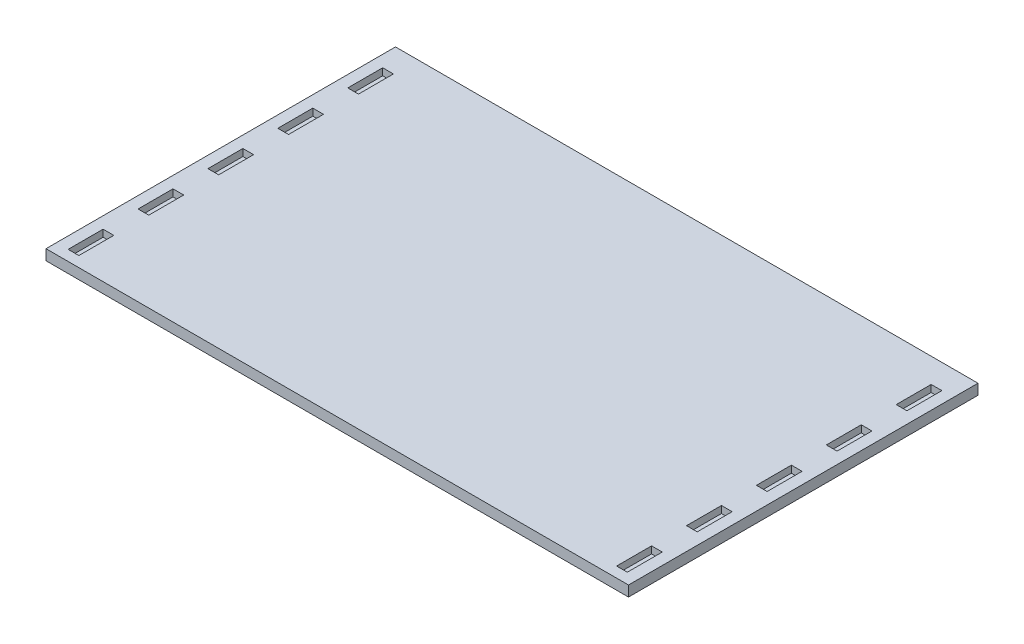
ISO-10303-21;
HEADER;
FILE_DESCRIPTION(('STEP AP214'),'2;1');
FILE_NAME('part.step','',(''),(''),'','','');
FILE_SCHEMA(('AUTOMOTIVE_DESIGN { 1 0 10303 214 1 1 1 1 }'));
ENDSEC;
DATA;
#1=APPLICATION_CONTEXT('core data for automotive mechanical design processes');
#2=APPLICATION_PROTOCOL_DEFINITION('international standard','automotive_design',2000,#1);
#3=PRODUCT_CONTEXT('',#1,'mechanical');
#4=PRODUCT('Part','Part','',(#3));
#5=PRODUCT_RELATED_PRODUCT_CATEGORY('part','',(#4));
#6=PRODUCT_DEFINITION_FORMATION('','',#4);
#7=PRODUCT_DEFINITION_CONTEXT('part definition',#1,'design');
#8=PRODUCT_DEFINITION('design','',#6,#7);
#9=PRODUCT_DEFINITION_SHAPE('','',#8);
#10=(LENGTH_UNIT() NAMED_UNIT(*) SI_UNIT(.MILLI.,.METRE.));
#11=(NAMED_UNIT(*) PLANE_ANGLE_UNIT() SI_UNIT($,.RADIAN.));
#12=(NAMED_UNIT(*) SI_UNIT($,.STERADIAN.) SOLID_ANGLE_UNIT());
#13=UNCERTAINTY_MEASURE_WITH_UNIT(LENGTH_MEASURE(1.E-05),#10,'distance_accuracy_value','');
#14=(GEOMETRIC_REPRESENTATION_CONTEXT(3) GLOBAL_UNCERTAINTY_ASSIGNED_CONTEXT((#13)) GLOBAL_UNIT_ASSIGNED_CONTEXT((#10,
#11,#12)) REPRESENTATION_CONTEXT('',''));
#15=CARTESIAN_POINT('',(0.,0.,0.));
#16=DIRECTION('',(0.,0.,1.));
#17=DIRECTION('',(1.,0.,0.));
#18=AXIS2_PLACEMENT_3D('',#15,#16,#17);
#19=CARTESIAN_POINT('',(0.,6.,480.));
#20=DIRECTION('',(0.,1.,0.));
#21=DIRECTION('',(0.,0.,1.));
#22=AXIS2_PLACEMENT_3D('',#19,#20,#21);
#23=PLANE('',#22);
#24=DIRECTION('',(0.,0.,1.));
#25=VECTOR('',#24,1.);
#26=CARTESIAN_POINT('',(260.90800995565,6.,212.750915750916));
#27=LINE('',#26,#25);
#28=CARTESIAN_POINT('',(260.90800995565,6.,212.750915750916));
#29=VERTEX_POINT('',#28);
#30=CARTESIAN_POINT('',(260.90800995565,6.,272.750915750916));
#31=VERTEX_POINT('',#30);
#32=EDGE_CURVE('E666',#29,#31,#27,.T.);
#33=ORIENTED_EDGE('',*,*,#32,.T.);
#34=DIRECTION('',(1.,0.,0.));
#35=VECTOR('',#34,1.);
#36=CARTESIAN_POINT('',(260.90800995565,6.,272.750915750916));
#37=LINE('',#36,#35);
#38=CARTESIAN_POINT('',(279.30800995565,6.,272.750915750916));
#39=VERTEX_POINT('',#38);
#40=EDGE_CURVE('E11',#31,#39,#37,.T.);
#41=ORIENTED_EDGE('',*,*,#40,.T.);
#42=DIRECTION('',(0.,0.,-1.));
#43=VECTOR('',#42,1.);
#44=CARTESIAN_POINT('',(279.30800995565,6.,212.750915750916));
#45=LINE('',#44,#43);
#46=CARTESIAN_POINT('',(279.30800995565,6.,212.750915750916));
#47=VERTEX_POINT('',#46);
#48=EDGE_CURVE('E46',#39,#47,#45,.T.);
#49=ORIENTED_EDGE('',*,*,#48,.T.);
#50=DIRECTION('',(-1.,0.,0.));
#51=VECTOR('',#50,1.);
#52=CARTESIAN_POINT('',(260.90800995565,6.,212.750915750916));
#53=LINE('',#52,#51);
#54=EDGE_CURVE('E54',#47,#29,#53,.T.);
#55=ORIENTED_EDGE('',*,*,#54,.T.);
#56=EDGE_LOOP('',(#33,#41,#49,#55));
#57=FACE_BOUND('',#56,.T.);
#58=ADVANCED_FACE('F32',(#57),#23,.T.);
#59=CARTESIAN_POINT('',(260.90800995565,6.,272.750915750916));
#60=DIRECTION('',(0.,0.,1.));
#61=DIRECTION('',(1.,0.,0.));
#62=AXIS2_PLACEMENT_3D('',#59,#60,#61);
#63=PLANE('',#62);
#64=DIRECTION('',(1.,0.,0.));
#65=VECTOR('',#64,1.);
#66=CARTESIAN_POINT('',(260.90800995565,18.,272.750915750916));
#67=LINE('',#66,#65);
#68=CARTESIAN_POINT('',(260.90800995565,18.,272.750915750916));
#69=VERTEX_POINT('',#68);
#70=CARTESIAN_POINT('',(279.30800995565,18.,272.750915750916));
#71=VERTEX_POINT('',#70);
#72=EDGE_CURVE('E660',#69,#71,#67,.T.);
#73=ORIENTED_EDGE('',*,*,#72,.T.);
#74=DIRECTION('',(0.,1.,0.));
#75=VECTOR('',#74,1.);
#76=CARTESIAN_POINT('',(279.30800995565,6.,272.750915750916));
#77=LINE('',#76,#75);
#78=EDGE_CURVE('E39',#39,#71,#77,.T.);
#79=ORIENTED_EDGE('',*,*,#78,.F.);
#80=ORIENTED_EDGE('',*,*,#40,.F.);
#81=DIRECTION('',(0.,1.,0.));
#82=VECTOR('',#81,1.);
#83=CARTESIAN_POINT('',(260.90800995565,6.,272.750915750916));
#84=LINE('',#83,#82);
#85=EDGE_CURVE('E663',#31,#69,#84,.T.);
#86=ORIENTED_EDGE('',*,*,#85,.T.);
#87=EDGE_LOOP('',(#73,#79,#80,#86));
#88=FACE_BOUND('',#87,.T.);
#89=ADVANCED_FACE('F678',(#88),#63,.F.);
#90=CARTESIAN_POINT('',(279.30800995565,6.,212.750915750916));
#91=DIRECTION('',(1.,0.,0.));
#92=DIRECTION('',(0.,0.,-1.));
#93=AXIS2_PLACEMENT_3D('',#90,#91,#92);
#94=PLANE('',#93);
#95=DIRECTION('',(0.,0.,-1.));
#96=VECTOR('',#95,1.);
#97=CARTESIAN_POINT('',(279.30800995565,18.,212.750915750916));
#98=LINE('',#97,#96);
#99=CARTESIAN_POINT('',(279.30800995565,18.,212.750915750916));
#100=VERTEX_POINT('',#99);
#101=EDGE_CURVE('E657',#71,#100,#98,.T.);
#102=ORIENTED_EDGE('',*,*,#101,.T.);
#103=DIRECTION('',(0.,1.,0.));
#104=VECTOR('',#103,1.);
#105=CARTESIAN_POINT('',(279.30800995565,6.,212.750915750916));
#106=LINE('',#105,#104);
#107=EDGE_CURVE('E673',#47,#100,#106,.T.);
#108=ORIENTED_EDGE('',*,*,#107,.F.);
#109=ORIENTED_EDGE('',*,*,#48,.F.);
#110=ORIENTED_EDGE('',*,*,#78,.T.);
#111=EDGE_LOOP('',(#102,#108,#109,#110));
#112=FACE_BOUND('',#111,.T.);
#113=ADVANCED_FACE('F675',(#112),#94,.F.);
#114=CARTESIAN_POINT('',(260.90800995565,6.,212.750915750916));
#115=DIRECTION('',(0.,0.,-1.));
#116=DIRECTION('',(-1.,0.,0.));
#117=AXIS2_PLACEMENT_3D('',#114,#115,#116);
#118=PLANE('',#117);
#119=DIRECTION('',(-1.,0.,0.));
#120=VECTOR('',#119,1.);
#121=CARTESIAN_POINT('',(260.90800995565,18.,212.750915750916));
#122=LINE('',#121,#120);
#123=CARTESIAN_POINT('',(260.90800995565,18.,212.750915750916));
#124=VERTEX_POINT('',#123);
#125=EDGE_CURVE('E654',#100,#124,#122,.T.);
#126=ORIENTED_EDGE('',*,*,#125,.T.);
#127=DIRECTION('',(0.,1.,0.));
#128=VECTOR('',#127,1.);
#129=CARTESIAN_POINT('',(260.90800995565,6.,212.750915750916));
#130=LINE('',#129,#128);
#131=EDGE_CURVE('E669',#29,#124,#130,.T.);
#132=ORIENTED_EDGE('',*,*,#131,.F.);
#133=ORIENTED_EDGE('',*,*,#54,.F.);
#134=ORIENTED_EDGE('',*,*,#107,.T.);
#135=EDGE_LOOP('',(#126,#132,#133,#134));
#136=FACE_BOUND('',#135,.T.);
#137=ADVANCED_FACE('F683',(#136),#118,.F.);
#138=CARTESIAN_POINT('',(260.90800995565,6.,212.750915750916));
#139=DIRECTION('',(-1.,0.,0.));
#140=DIRECTION('',(0.,0.,1.));
#141=AXIS2_PLACEMENT_3D('',#138,#139,#140);
#142=PLANE('',#141);
#143=DIRECTION('',(0.,0.,1.));
#144=VECTOR('',#143,1.);
#145=CARTESIAN_POINT('',(260.90800995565,18.,212.750915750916));
#146=LINE('',#145,#144);
#147=EDGE_CURVE('E652',#124,#69,#146,.T.);
#148=ORIENTED_EDGE('',*,*,#147,.T.);
#149=ORIENTED_EDGE('',*,*,#85,.F.);
#150=ORIENTED_EDGE('',*,*,#32,.F.);
#151=ORIENTED_EDGE('',*,*,#131,.T.);
#152=EDGE_LOOP('',(#148,#149,#150,#151));
#153=FACE_BOUND('',#152,.T.);
#154=ADVANCED_FACE('F682',(#153),#142,.F.);
#155=CARTESIAN_POINT('',(0.,6.,360.));
#156=DIRECTION('',(0.,1.,0.));
#157=DIRECTION('',(0.,0.,1.));
#158=AXIS2_PLACEMENT_3D('',#155,#156,#157);
#159=PLANE('',#158);
#160=DIRECTION('',(0.,0.,1.));
#161=VECTOR('',#160,1.);
#162=CARTESIAN_POINT('',(260.90800995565,6.,92.7509157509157));
#163=LINE('',#162,#161);
#164=CARTESIAN_POINT('',(260.90800995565,6.,92.7509157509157));
#165=VERTEX_POINT('',#164);
#166=CARTESIAN_POINT('',(260.90800995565,6.,152.750915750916));
#167=VERTEX_POINT('',#166);
#168=EDGE_CURVE('E631',#165,#167,#163,.T.);
#169=ORIENTED_EDGE('',*,*,#168,.T.);
#170=DIRECTION('',(1.,0.,0.));
#171=VECTOR('',#170,1.);
#172=CARTESIAN_POINT('',(260.90800995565,6.,152.750915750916));
#173=LINE('',#172,#171);
#174=CARTESIAN_POINT('',(279.30800995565,6.,152.750915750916));
#175=VERTEX_POINT('',#174);
#176=EDGE_CURVE('E649',#167,#175,#173,.T.);
#177=ORIENTED_EDGE('',*,*,#176,.T.);
#178=DIRECTION('',(0.,0.,-1.));
#179=VECTOR('',#178,1.);
#180=CARTESIAN_POINT('',(279.30800995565,6.,92.7509157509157));
#181=LINE('',#180,#179);
#182=CARTESIAN_POINT('',(279.30800995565,6.,92.7509157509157));
#183=VERTEX_POINT('',#182);
#184=EDGE_CURVE('E643',#175,#183,#181,.T.);
#185=ORIENTED_EDGE('',*,*,#184,.T.);
#186=DIRECTION('',(-1.,0.,0.));
#187=VECTOR('',#186,1.);
#188=CARTESIAN_POINT('',(260.90800995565,6.,92.7509157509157));
#189=LINE('',#188,#187);
#190=EDGE_CURVE('E637',#183,#165,#189,.T.);
#191=ORIENTED_EDGE('',*,*,#190,.T.);
#192=EDGE_LOOP('',(#169,#177,#185,#191));
#193=FACE_BOUND('',#192,.T.);
#194=ADVANCED_FACE('F716',(#193),#159,.T.);
#195=CARTESIAN_POINT('',(260.90800995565,6.,152.750915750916));
#196=DIRECTION('',(0.,0.,1.));
#197=DIRECTION('',(1.,0.,0.));
#198=AXIS2_PLACEMENT_3D('',#195,#196,#197);
#199=PLANE('',#198);
#200=DIRECTION('',(1.,0.,0.));
#201=VECTOR('',#200,1.);
#202=CARTESIAN_POINT('',(260.90800995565,18.,152.750915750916));
#203=LINE('',#202,#201);
#204=CARTESIAN_POINT('',(260.90800995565,18.,152.750915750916));
#205=VERTEX_POINT('',#204);
#206=CARTESIAN_POINT('',(279.30800995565,18.,152.750915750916));
#207=VERTEX_POINT('',#206);
#208=EDGE_CURVE('E625',#205,#207,#203,.T.);
#209=ORIENTED_EDGE('',*,*,#208,.T.);
#210=DIRECTION('',(0.,1.,0.));
#211=VECTOR('',#210,1.);
#212=CARTESIAN_POINT('',(279.30800995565,6.,152.750915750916));
#213=LINE('',#212,#211);
#214=EDGE_CURVE('E646',#175,#207,#213,.T.);
#215=ORIENTED_EDGE('',*,*,#214,.F.);
#216=ORIENTED_EDGE('',*,*,#176,.F.);
#217=DIRECTION('',(0.,1.,0.));
#218=VECTOR('',#217,1.);
#219=CARTESIAN_POINT('',(260.90800995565,6.,152.750915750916));
#220=LINE('',#219,#218);
#221=EDGE_CURVE('E628',#167,#205,#220,.T.);
#222=ORIENTED_EDGE('',*,*,#221,.T.);
#223=EDGE_LOOP('',(#209,#215,#216,#222));
#224=FACE_BOUND('',#223,.T.);
#225=ADVANCED_FACE('F719',(#224),#199,.F.);
#226=CARTESIAN_POINT('',(279.30800995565,6.,92.7509157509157));
#227=DIRECTION('',(1.,0.,0.));
#228=DIRECTION('',(0.,0.,-1.));
#229=AXIS2_PLACEMENT_3D('',#226,#227,#228);
#230=PLANE('',#229);
#231=DIRECTION('',(0.,0.,-1.));
#232=VECTOR('',#231,1.);
#233=CARTESIAN_POINT('',(279.30800995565,18.,92.7509157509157));
#234=LINE('',#233,#232);
#235=CARTESIAN_POINT('',(279.30800995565,18.,92.7509157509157));
#236=VERTEX_POINT('',#235);
#237=EDGE_CURVE('E622',#207,#236,#234,.T.);
#238=ORIENTED_EDGE('',*,*,#237,.T.);
#239=DIRECTION('',(0.,1.,0.));
#240=VECTOR('',#239,1.);
#241=CARTESIAN_POINT('',(279.30800995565,6.,92.7509157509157));
#242=LINE('',#241,#240);
#243=EDGE_CURVE('E640',#183,#236,#242,.T.);
#244=ORIENTED_EDGE('',*,*,#243,.F.);
#245=ORIENTED_EDGE('',*,*,#184,.F.);
#246=ORIENTED_EDGE('',*,*,#214,.T.);
#247=EDGE_LOOP('',(#238,#244,#245,#246));
#248=FACE_BOUND('',#247,.T.);
#249=ADVANCED_FACE('F723',(#248),#230,.F.);
#250=CARTESIAN_POINT('',(260.90800995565,6.,92.7509157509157));
#251=DIRECTION('',(0.,0.,-1.));
#252=DIRECTION('',(-1.,0.,0.));
#253=AXIS2_PLACEMENT_3D('',#250,#251,#252);
#254=PLANE('',#253);
#255=DIRECTION('',(-1.,0.,0.));
#256=VECTOR('',#255,1.);
#257=CARTESIAN_POINT('',(260.90800995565,18.,92.7509157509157));
#258=LINE('',#257,#256);
#259=CARTESIAN_POINT('',(260.90800995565,18.,92.7509157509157));
#260=VERTEX_POINT('',#259);
#261=EDGE_CURVE('E619',#236,#260,#258,.T.);
#262=ORIENTED_EDGE('',*,*,#261,.T.);
#263=DIRECTION('',(0.,1.,0.));
#264=VECTOR('',#263,1.);
#265=CARTESIAN_POINT('',(260.90800995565,6.,92.7509157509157));
#266=LINE('',#265,#264);
#267=EDGE_CURVE('E634',#165,#260,#266,.T.);
#268=ORIENTED_EDGE('',*,*,#267,.F.);
#269=ORIENTED_EDGE('',*,*,#190,.F.);
#270=ORIENTED_EDGE('',*,*,#243,.T.);
#271=EDGE_LOOP('',(#262,#268,#269,#270));
#272=FACE_BOUND('',#271,.T.);
#273=ADVANCED_FACE('F727',(#272),#254,.F.);
#274=CARTESIAN_POINT('',(260.90800995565,6.,92.7509157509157));
#275=DIRECTION('',(-1.,0.,0.));
#276=DIRECTION('',(0.,0.,1.));
#277=AXIS2_PLACEMENT_3D('',#274,#275,#276);
#278=PLANE('',#277);
#279=DIRECTION('',(0.,0.,1.));
#280=VECTOR('',#279,1.);
#281=CARTESIAN_POINT('',(260.90800995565,18.,92.7509157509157));
#282=LINE('',#281,#280);
#283=EDGE_CURVE('E617',#260,#205,#282,.T.);
#284=ORIENTED_EDGE('',*,*,#283,.T.);
#285=ORIENTED_EDGE('',*,*,#221,.F.);
#286=ORIENTED_EDGE('',*,*,#168,.F.);
#287=ORIENTED_EDGE('',*,*,#267,.T.);
#288=EDGE_LOOP('',(#284,#285,#286,#287));
#289=FACE_BOUND('',#288,.T.);
#290=ADVANCED_FACE('F731',(#289),#278,.F.);
#291=CARTESIAN_POINT('',(0.,6.,240.));
#292=DIRECTION('',(0.,1.,0.));
#293=DIRECTION('',(0.,0.,1.));
#294=AXIS2_PLACEMENT_3D('',#291,#292,#293);
#295=PLANE('',#294);
#296=DIRECTION('',(0.,0.,1.));
#297=VECTOR('',#296,1.);
#298=CARTESIAN_POINT('',(260.90800995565,6.,-27.2490842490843));
#299=LINE('',#298,#297);
#300=CARTESIAN_POINT('',(260.90800995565,6.,-27.2490842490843));
#301=VERTEX_POINT('',#300);
#302=CARTESIAN_POINT('',(260.90800995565,6.,32.7509157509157));
#303=VERTEX_POINT('',#302);
#304=EDGE_CURVE('E596',#301,#303,#299,.T.);
#305=ORIENTED_EDGE('',*,*,#304,.T.);
#306=DIRECTION('',(1.,0.,0.));
#307=VECTOR('',#306,1.);
#308=CARTESIAN_POINT('',(260.90800995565,6.,32.7509157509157));
#309=LINE('',#308,#307);
#310=CARTESIAN_POINT('',(279.30800995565,6.,32.7509157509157));
#311=VERTEX_POINT('',#310);
#312=EDGE_CURVE('E614',#303,#311,#309,.T.);
#313=ORIENTED_EDGE('',*,*,#312,.T.);
#314=DIRECTION('',(0.,0.,-1.));
#315=VECTOR('',#314,1.);
#316=CARTESIAN_POINT('',(279.30800995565,6.,-27.2490842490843));
#317=LINE('',#316,#315);
#318=CARTESIAN_POINT('',(279.30800995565,6.,-27.2490842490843));
#319=VERTEX_POINT('',#318);
#320=EDGE_CURVE('E608',#311,#319,#317,.T.);
#321=ORIENTED_EDGE('',*,*,#320,.T.);
#322=DIRECTION('',(-1.,0.,0.));
#323=VECTOR('',#322,1.);
#324=CARTESIAN_POINT('',(260.90800995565,6.,-27.2490842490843));
#325=LINE('',#324,#323);
#326=EDGE_CURVE('E602',#319,#301,#325,.T.);
#327=ORIENTED_EDGE('',*,*,#326,.T.);
#328=EDGE_LOOP('',(#305,#313,#321,#327));
#329=FACE_BOUND('',#328,.T.);
#330=ADVANCED_FACE('F735',(#329),#295,.T.);
#331=CARTESIAN_POINT('',(260.90800995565,6.,32.7509157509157));
#332=DIRECTION('',(0.,0.,1.));
#333=DIRECTION('',(1.,0.,0.));
#334=AXIS2_PLACEMENT_3D('',#331,#332,#333);
#335=PLANE('',#334);
#336=DIRECTION('',(1.,0.,0.));
#337=VECTOR('',#336,1.);
#338=CARTESIAN_POINT('',(260.90800995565,18.,32.7509157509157));
#339=LINE('',#338,#337);
#340=CARTESIAN_POINT('',(260.90800995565,18.,32.7509157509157));
#341=VERTEX_POINT('',#340);
#342=CARTESIAN_POINT('',(279.30800995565,18.,32.7509157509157));
#343=VERTEX_POINT('',#342);
#344=EDGE_CURVE('E590',#341,#343,#339,.T.);
#345=ORIENTED_EDGE('',*,*,#344,.T.);
#346=DIRECTION('',(0.,1.,0.));
#347=VECTOR('',#346,1.);
#348=CARTESIAN_POINT('',(279.30800995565,6.,32.7509157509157));
#349=LINE('',#348,#347);
#350=EDGE_CURVE('E611',#311,#343,#349,.T.);
#351=ORIENTED_EDGE('',*,*,#350,.F.);
#352=ORIENTED_EDGE('',*,*,#312,.F.);
#353=DIRECTION('',(0.,1.,0.));
#354=VECTOR('',#353,1.);
#355=CARTESIAN_POINT('',(260.90800995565,6.,32.7509157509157));
#356=LINE('',#355,#354);
#357=EDGE_CURVE('E593',#303,#341,#356,.T.);
#358=ORIENTED_EDGE('',*,*,#357,.T.);
#359=EDGE_LOOP('',(#345,#351,#352,#358));
#360=FACE_BOUND('',#359,.T.);
#361=ADVANCED_FACE('F739',(#360),#335,.F.);
#362=CARTESIAN_POINT('',(279.30800995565,6.,-27.2490842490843));
#363=DIRECTION('',(1.,0.,0.));
#364=DIRECTION('',(0.,0.,-1.));
#365=AXIS2_PLACEMENT_3D('',#362,#363,#364);
#366=PLANE('',#365);
#367=DIRECTION('',(0.,0.,-1.));
#368=VECTOR('',#367,1.);
#369=CARTESIAN_POINT('',(279.30800995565,18.,-27.2490842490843));
#370=LINE('',#369,#368);
#371=CARTESIAN_POINT('',(279.30800995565,18.,-27.2490842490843));
#372=VERTEX_POINT('',#371);
#373=EDGE_CURVE('E587',#343,#372,#370,.T.);
#374=ORIENTED_EDGE('',*,*,#373,.T.);
#375=DIRECTION('',(0.,1.,0.));
#376=VECTOR('',#375,1.);
#377=CARTESIAN_POINT('',(279.30800995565,6.,-27.2490842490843));
#378=LINE('',#377,#376);
#379=EDGE_CURVE('E605',#319,#372,#378,.T.);
#380=ORIENTED_EDGE('',*,*,#379,.F.);
#381=ORIENTED_EDGE('',*,*,#320,.F.);
#382=ORIENTED_EDGE('',*,*,#350,.T.);
#383=EDGE_LOOP('',(#374,#380,#381,#382));
#384=FACE_BOUND('',#383,.T.);
#385=ADVANCED_FACE('F743',(#384),#366,.F.);
#386=CARTESIAN_POINT('',(260.90800995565,6.,-27.2490842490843));
#387=DIRECTION('',(0.,0.,-1.));
#388=DIRECTION('',(-1.,0.,0.));
#389=AXIS2_PLACEMENT_3D('',#386,#387,#388);
#390=PLANE('',#389);
#391=DIRECTION('',(-1.,0.,0.));
#392=VECTOR('',#391,1.);
#393=CARTESIAN_POINT('',(260.90800995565,18.,-27.2490842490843));
#394=LINE('',#393,#392);
#395=CARTESIAN_POINT('',(260.90800995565,18.,-27.2490842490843));
#396=VERTEX_POINT('',#395);
#397=EDGE_CURVE('E584',#372,#396,#394,.T.);
#398=ORIENTED_EDGE('',*,*,#397,.T.);
#399=DIRECTION('',(0.,1.,0.));
#400=VECTOR('',#399,1.);
#401=CARTESIAN_POINT('',(260.90800995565,6.,-27.2490842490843));
#402=LINE('',#401,#400);
#403=EDGE_CURVE('E599',#301,#396,#402,.T.);
#404=ORIENTED_EDGE('',*,*,#403,.F.);
#405=ORIENTED_EDGE('',*,*,#326,.F.);
#406=ORIENTED_EDGE('',*,*,#379,.T.);
#407=EDGE_LOOP('',(#398,#404,#405,#406));
#408=FACE_BOUND('',#407,.T.);
#409=ADVANCED_FACE('F747',(#408),#390,.F.);
#410=CARTESIAN_POINT('',(260.90800995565,6.,-27.2490842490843));
#411=DIRECTION('',(-1.,0.,0.));
#412=DIRECTION('',(0.,0.,1.));
#413=AXIS2_PLACEMENT_3D('',#410,#411,#412);
#414=PLANE('',#413);
#415=DIRECTION('',(0.,0.,1.));
#416=VECTOR('',#415,1.);
#417=CARTESIAN_POINT('',(260.90800995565,18.,-27.2490842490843));
#418=LINE('',#417,#416);
#419=EDGE_CURVE('E582',#396,#341,#418,.T.);
#420=ORIENTED_EDGE('',*,*,#419,.T.);
#421=ORIENTED_EDGE('',*,*,#357,.F.);
#422=ORIENTED_EDGE('',*,*,#304,.F.);
#423=ORIENTED_EDGE('',*,*,#403,.T.);
#424=EDGE_LOOP('',(#420,#421,#422,#423));
#425=FACE_BOUND('',#424,.T.);
#426=ADVANCED_FACE('F751',(#425),#414,.F.);
#427=CARTESIAN_POINT('',(0.,6.,480.));
#428=DIRECTION('',(0.,-1.,0.));
#429=DIRECTION('',(0.,0.,-1.));
#430=AXIS2_PLACEMENT_3D('',#427,#428,#429);
#431=PLANE('',#430);
#432=DIRECTION('',(0.,0.,-1.));
#433=VECTOR('',#432,1.);
#434=CARTESIAN_POINT('',(-662.29199004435,6.,212.750915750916));
#435=LINE('',#434,#433);
#436=CARTESIAN_POINT('',(-662.29199004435,6.,272.750915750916));
#437=VERTEX_POINT('',#436);
#438=CARTESIAN_POINT('',(-662.29199004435,6.,212.750915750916));
#439=VERTEX_POINT('',#438);
#440=EDGE_CURVE('E561',#437,#439,#435,.T.);
#441=ORIENTED_EDGE('',*,*,#440,.T.);
#442=DIRECTION('',(-1.,0.,0.));
#443=VECTOR('',#442,1.);
#444=CARTESIAN_POINT('',(-662.29199004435,6.,212.750915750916));
#445=LINE('',#444,#443);
#446=CARTESIAN_POINT('',(-680.69199004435,6.,212.750915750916));
#447=VERTEX_POINT('',#446);
#448=EDGE_CURVE('E579',#439,#447,#445,.T.);
#449=ORIENTED_EDGE('',*,*,#448,.T.);
#450=DIRECTION('',(0.,0.,1.));
#451=VECTOR('',#450,1.);
#452=CARTESIAN_POINT('',(-680.69199004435,6.,212.750915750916));
#453=LINE('',#452,#451);
#454=CARTESIAN_POINT('',(-680.69199004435,6.,272.750915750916));
#455=VERTEX_POINT('',#454);
#456=EDGE_CURVE('E573',#447,#455,#453,.T.);
#457=ORIENTED_EDGE('',*,*,#456,.T.);
#458=DIRECTION('',(1.,0.,0.));
#459=VECTOR('',#458,1.);
#460=CARTESIAN_POINT('',(-662.29199004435,6.,272.750915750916));
#461=LINE('',#460,#459);
#462=EDGE_CURVE('E567',#455,#437,#461,.T.);
#463=ORIENTED_EDGE('',*,*,#462,.T.);
#464=EDGE_LOOP('',(#441,#449,#457,#463));
#465=FACE_BOUND('',#464,.T.);
#466=ADVANCED_FACE('F755',(#465),#431,.F.);
#467=CARTESIAN_POINT('',(-662.29199004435,6.,212.750915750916));
#468=DIRECTION('',(0.,0.,-1.));
#469=DIRECTION('',(-1.,0.,0.));
#470=AXIS2_PLACEMENT_3D('',#467,#468,#469);
#471=PLANE('',#470);
#472=DIRECTION('',(-1.,0.,0.));
#473=VECTOR('',#472,1.);
#474=CARTESIAN_POINT('',(-662.29199004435,18.,212.750915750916));
#475=LINE('',#474,#473);
#476=CARTESIAN_POINT('',(-662.29199004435,18.,212.750915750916));
#477=VERTEX_POINT('',#476);
#478=CARTESIAN_POINT('',(-680.69199004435,18.,212.750915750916));
#479=VERTEX_POINT('',#478);
#480=EDGE_CURVE('E555',#477,#479,#475,.T.);
#481=ORIENTED_EDGE('',*,*,#480,.T.);
#482=DIRECTION('',(0.,1.,0.));
#483=VECTOR('',#482,1.);
#484=CARTESIAN_POINT('',(-680.69199004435,6.,212.750915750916));
#485=LINE('',#484,#483);
#486=EDGE_CURVE('E576',#447,#479,#485,.T.);
#487=ORIENTED_EDGE('',*,*,#486,.F.);
#488=ORIENTED_EDGE('',*,*,#448,.F.);
#489=DIRECTION('',(0.,1.,0.));
#490=VECTOR('',#489,1.);
#491=CARTESIAN_POINT('',(-662.29199004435,6.,212.750915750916));
#492=LINE('',#491,#490);
#493=EDGE_CURVE('E558',#439,#477,#492,.T.);
#494=ORIENTED_EDGE('',*,*,#493,.T.);
#495=EDGE_LOOP('',(#481,#487,#488,#494));
#496=FACE_BOUND('',#495,.T.);
#497=ADVANCED_FACE('F759',(#496),#471,.F.);
#498=CARTESIAN_POINT('',(-680.69199004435,6.,212.750915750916));
#499=DIRECTION('',(-1.,0.,0.));
#500=DIRECTION('',(0.,0.,1.));
#501=AXIS2_PLACEMENT_3D('',#498,#499,#500);
#502=PLANE('',#501);
#503=DIRECTION('',(0.,0.,1.));
#504=VECTOR('',#503,1.);
#505=CARTESIAN_POINT('',(-680.69199004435,18.,212.750915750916));
#506=LINE('',#505,#504);
#507=CARTESIAN_POINT('',(-680.69199004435,18.,272.750915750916));
#508=VERTEX_POINT('',#507);
#509=EDGE_CURVE('E552',#479,#508,#506,.T.);
#510=ORIENTED_EDGE('',*,*,#509,.T.);
#511=DIRECTION('',(0.,1.,0.));
#512=VECTOR('',#511,1.);
#513=CARTESIAN_POINT('',(-680.69199004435,6.,272.750915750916));
#514=LINE('',#513,#512);
#515=EDGE_CURVE('E570',#455,#508,#514,.T.);
#516=ORIENTED_EDGE('',*,*,#515,.F.);
#517=ORIENTED_EDGE('',*,*,#456,.F.);
#518=ORIENTED_EDGE('',*,*,#486,.T.);
#519=EDGE_LOOP('',(#510,#516,#517,#518));
#520=FACE_BOUND('',#519,.T.);
#521=ADVANCED_FACE('F763',(#520),#502,.F.);
#522=CARTESIAN_POINT('',(-662.29199004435,6.,272.750915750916));
#523=DIRECTION('',(0.,0.,1.));
#524=DIRECTION('',(1.,0.,0.));
#525=AXIS2_PLACEMENT_3D('',#522,#523,#524);
#526=PLANE('',#525);
#527=DIRECTION('',(1.,0.,0.));
#528=VECTOR('',#527,1.);
#529=CARTESIAN_POINT('',(-662.29199004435,18.,272.750915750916));
#530=LINE('',#529,#528);
#531=CARTESIAN_POINT('',(-662.29199004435,18.,272.750915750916));
#532=VERTEX_POINT('',#531);
#533=EDGE_CURVE('E549',#508,#532,#530,.T.);
#534=ORIENTED_EDGE('',*,*,#533,.T.);
#535=DIRECTION('',(0.,1.,0.));
#536=VECTOR('',#535,1.);
#537=CARTESIAN_POINT('',(-662.29199004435,6.,272.750915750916));
#538=LINE('',#537,#536);
#539=EDGE_CURVE('E564',#437,#532,#538,.T.);
#540=ORIENTED_EDGE('',*,*,#539,.F.);
#541=ORIENTED_EDGE('',*,*,#462,.F.);
#542=ORIENTED_EDGE('',*,*,#515,.T.);
#543=EDGE_LOOP('',(#534,#540,#541,#542));
#544=FACE_BOUND('',#543,.T.);
#545=ADVANCED_FACE('F767',(#544),#526,.F.);
#546=CARTESIAN_POINT('',(-662.29199004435,6.,212.750915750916));
#547=DIRECTION('',(1.,0.,0.));
#548=DIRECTION('',(0.,0.,-1.));
#549=AXIS2_PLACEMENT_3D('',#546,#547,#548);
#550=PLANE('',#549);
#551=DIRECTION('',(0.,0.,-1.));
#552=VECTOR('',#551,1.);
#553=CARTESIAN_POINT('',(-662.29199004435,18.,212.750915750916));
#554=LINE('',#553,#552);
#555=EDGE_CURVE('E547',#532,#477,#554,.T.);
#556=ORIENTED_EDGE('',*,*,#555,.T.);
#557=ORIENTED_EDGE('',*,*,#493,.F.);
#558=ORIENTED_EDGE('',*,*,#440,.F.);
#559=ORIENTED_EDGE('',*,*,#539,.T.);
#560=EDGE_LOOP('',(#556,#557,#558,#559));
#561=FACE_BOUND('',#560,.T.);
#562=ADVANCED_FACE('F771',(#561),#550,.F.);
#563=CARTESIAN_POINT('',(0.,6.,360.));
#564=DIRECTION('',(0.,-1.,0.));
#565=DIRECTION('',(0.,0.,-1.));
#566=AXIS2_PLACEMENT_3D('',#563,#564,#565);
#567=PLANE('',#566);
#568=DIRECTION('',(0.,0.,-1.));
#569=VECTOR('',#568,1.);
#570=CARTESIAN_POINT('',(-662.29199004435,6.,92.7509157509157));
#571=LINE('',#570,#569);
#572=CARTESIAN_POINT('',(-662.29199004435,6.,152.750915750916));
#573=VERTEX_POINT('',#572);
#574=CARTESIAN_POINT('',(-662.29199004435,6.,92.7509157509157));
#575=VERTEX_POINT('',#574);
#576=EDGE_CURVE('E526',#573,#575,#571,.T.);
#577=ORIENTED_EDGE('',*,*,#576,.T.);
#578=DIRECTION('',(-1.,0.,0.));
#579=VECTOR('',#578,1.);
#580=CARTESIAN_POINT('',(-662.29199004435,6.,92.7509157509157));
#581=LINE('',#580,#579);
#582=CARTESIAN_POINT('',(-680.69199004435,6.,92.7509157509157));
#583=VERTEX_POINT('',#582);
#584=EDGE_CURVE('E544',#575,#583,#581,.T.);
#585=ORIENTED_EDGE('',*,*,#584,.T.);
#586=DIRECTION('',(0.,0.,1.));
#587=VECTOR('',#586,1.);
#588=CARTESIAN_POINT('',(-680.69199004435,6.,92.7509157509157));
#589=LINE('',#588,#587);
#590=CARTESIAN_POINT('',(-680.69199004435,6.,152.750915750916));
#591=VERTEX_POINT('',#590);
#592=EDGE_CURVE('E538',#583,#591,#589,.T.);
#593=ORIENTED_EDGE('',*,*,#592,.T.);
#594=DIRECTION('',(1.,0.,0.));
#595=VECTOR('',#594,1.);
#596=CARTESIAN_POINT('',(-662.29199004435,6.,152.750915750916));
#597=LINE('',#596,#595);
#598=EDGE_CURVE('E532',#591,#573,#597,.T.);
#599=ORIENTED_EDGE('',*,*,#598,.T.);
#600=EDGE_LOOP('',(#577,#585,#593,#599));
#601=FACE_BOUND('',#600,.T.);
#602=ADVANCED_FACE('F775',(#601),#567,.F.);
#603=CARTESIAN_POINT('',(-662.29199004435,6.,92.7509157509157));
#604=DIRECTION('',(0.,0.,-1.));
#605=DIRECTION('',(-1.,0.,0.));
#606=AXIS2_PLACEMENT_3D('',#603,#604,#605);
#607=PLANE('',#606);
#608=DIRECTION('',(-1.,0.,0.));
#609=VECTOR('',#608,1.);
#610=CARTESIAN_POINT('',(-662.29199004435,18.,92.7509157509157));
#611=LINE('',#610,#609);
#612=CARTESIAN_POINT('',(-662.29199004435,18.,92.7509157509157));
#613=VERTEX_POINT('',#612);
#614=CARTESIAN_POINT('',(-680.69199004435,18.,92.7509157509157));
#615=VERTEX_POINT('',#614);
#616=EDGE_CURVE('E520',#613,#615,#611,.T.);
#617=ORIENTED_EDGE('',*,*,#616,.T.);
#618=DIRECTION('',(0.,1.,0.));
#619=VECTOR('',#618,1.);
#620=CARTESIAN_POINT('',(-680.69199004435,6.,92.7509157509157));
#621=LINE('',#620,#619);
#622=EDGE_CURVE('E541',#583,#615,#621,.T.);
#623=ORIENTED_EDGE('',*,*,#622,.F.);
#624=ORIENTED_EDGE('',*,*,#584,.F.);
#625=DIRECTION('',(0.,1.,0.));
#626=VECTOR('',#625,1.);
#627=CARTESIAN_POINT('',(-662.29199004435,6.,92.7509157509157));
#628=LINE('',#627,#626);
#629=EDGE_CURVE('E523',#575,#613,#628,.T.);
#630=ORIENTED_EDGE('',*,*,#629,.T.);
#631=EDGE_LOOP('',(#617,#623,#624,#630));
#632=FACE_BOUND('',#631,.T.);
#633=ADVANCED_FACE('F779',(#632),#607,.F.);
#634=CARTESIAN_POINT('',(-680.69199004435,6.,92.7509157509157));
#635=DIRECTION('',(-1.,0.,0.));
#636=DIRECTION('',(0.,0.,1.));
#637=AXIS2_PLACEMENT_3D('',#634,#635,#636);
#638=PLANE('',#637);
#639=DIRECTION('',(0.,0.,1.));
#640=VECTOR('',#639,1.);
#641=CARTESIAN_POINT('',(-680.69199004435,18.,92.7509157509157));
#642=LINE('',#641,#640);
#643=CARTESIAN_POINT('',(-680.69199004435,18.,152.750915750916));
#644=VERTEX_POINT('',#643);
#645=EDGE_CURVE('E517',#615,#644,#642,.T.);
#646=ORIENTED_EDGE('',*,*,#645,.T.);
#647=DIRECTION('',(0.,1.,0.));
#648=VECTOR('',#647,1.);
#649=CARTESIAN_POINT('',(-680.69199004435,6.,152.750915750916));
#650=LINE('',#649,#648);
#651=EDGE_CURVE('E535',#591,#644,#650,.T.);
#652=ORIENTED_EDGE('',*,*,#651,.F.);
#653=ORIENTED_EDGE('',*,*,#592,.F.);
#654=ORIENTED_EDGE('',*,*,#622,.T.);
#655=EDGE_LOOP('',(#646,#652,#653,#654));
#656=FACE_BOUND('',#655,.T.);
#657=ADVANCED_FACE('F783',(#656),#638,.F.);
#658=CARTESIAN_POINT('',(-662.29199004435,6.,152.750915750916));
#659=DIRECTION('',(0.,0.,1.));
#660=DIRECTION('',(1.,0.,0.));
#661=AXIS2_PLACEMENT_3D('',#658,#659,#660);
#662=PLANE('',#661);
#663=DIRECTION('',(1.,0.,0.));
#664=VECTOR('',#663,1.);
#665=CARTESIAN_POINT('',(-662.29199004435,18.,152.750915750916));
#666=LINE('',#665,#664);
#667=CARTESIAN_POINT('',(-662.29199004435,18.,152.750915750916));
#668=VERTEX_POINT('',#667);
#669=EDGE_CURVE('E514',#644,#668,#666,.T.);
#670=ORIENTED_EDGE('',*,*,#669,.T.);
#671=DIRECTION('',(0.,1.,0.));
#672=VECTOR('',#671,1.);
#673=CARTESIAN_POINT('',(-662.29199004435,6.,152.750915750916));
#674=LINE('',#673,#672);
#675=EDGE_CURVE('E529',#573,#668,#674,.T.);
#676=ORIENTED_EDGE('',*,*,#675,.F.);
#677=ORIENTED_EDGE('',*,*,#598,.F.);
#678=ORIENTED_EDGE('',*,*,#651,.T.);
#679=EDGE_LOOP('',(#670,#676,#677,#678));
#680=FACE_BOUND('',#679,.T.);
#681=ADVANCED_FACE('F787',(#680),#662,.F.);
#682=CARTESIAN_POINT('',(-662.29199004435,6.,92.7509157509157));
#683=DIRECTION('',(1.,0.,0.));
#684=DIRECTION('',(0.,0.,-1.));
#685=AXIS2_PLACEMENT_3D('',#682,#683,#684);
#686=PLANE('',#685);
#687=DIRECTION('',(0.,0.,-1.));
#688=VECTOR('',#687,1.);
#689=CARTESIAN_POINT('',(-662.29199004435,18.,92.7509157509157));
#690=LINE('',#689,#688);
#691=EDGE_CURVE('E512',#668,#613,#690,.T.);
#692=ORIENTED_EDGE('',*,*,#691,.T.);
#693=ORIENTED_EDGE('',*,*,#629,.F.);
#694=ORIENTED_EDGE('',*,*,#576,.F.);
#695=ORIENTED_EDGE('',*,*,#675,.T.);
#696=EDGE_LOOP('',(#692,#693,#694,#695));
#697=FACE_BOUND('',#696,.T.);
#698=ADVANCED_FACE('F791',(#697),#686,.F.);
#699=CARTESIAN_POINT('',(0.,6.,240.));
#700=DIRECTION('',(0.,-1.,0.));
#701=DIRECTION('',(0.,0.,-1.));
#702=AXIS2_PLACEMENT_3D('',#699,#700,#701);
#703=PLANE('',#702);
#704=DIRECTION('',(0.,0.,-1.));
#705=VECTOR('',#704,1.);
#706=CARTESIAN_POINT('',(-662.29199004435,6.,-27.2490842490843));
#707=LINE('',#706,#705);
#708=CARTESIAN_POINT('',(-662.29199004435,6.,32.7509157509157));
#709=VERTEX_POINT('',#708);
#710=CARTESIAN_POINT('',(-662.29199004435,6.,-27.2490842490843));
#711=VERTEX_POINT('',#710);
#712=EDGE_CURVE('E491',#709,#711,#707,.T.);
#713=ORIENTED_EDGE('',*,*,#712,.T.);
#714=DIRECTION('',(-1.,0.,0.));
#715=VECTOR('',#714,1.);
#716=CARTESIAN_POINT('',(-662.29199004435,6.,-27.2490842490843));
#717=LINE('',#716,#715);
#718=CARTESIAN_POINT('',(-680.69199004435,6.,-27.2490842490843));
#719=VERTEX_POINT('',#718);
#720=EDGE_CURVE('E509',#711,#719,#717,.T.);
#721=ORIENTED_EDGE('',*,*,#720,.T.);
#722=DIRECTION('',(0.,0.,1.));
#723=VECTOR('',#722,1.);
#724=CARTESIAN_POINT('',(-680.69199004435,6.,-27.2490842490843));
#725=LINE('',#724,#723);
#726=CARTESIAN_POINT('',(-680.69199004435,6.,32.7509157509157));
#727=VERTEX_POINT('',#726);
#728=EDGE_CURVE('E503',#719,#727,#725,.T.);
#729=ORIENTED_EDGE('',*,*,#728,.T.);
#730=DIRECTION('',(1.,0.,0.));
#731=VECTOR('',#730,1.);
#732=CARTESIAN_POINT('',(-662.29199004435,6.,32.7509157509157));
#733=LINE('',#732,#731);
#734=EDGE_CURVE('E497',#727,#709,#733,.T.);
#735=ORIENTED_EDGE('',*,*,#734,.T.);
#736=EDGE_LOOP('',(#713,#721,#729,#735));
#737=FACE_BOUND('',#736,.T.);
#738=ADVANCED_FACE('F795',(#737),#703,.F.);
#739=CARTESIAN_POINT('',(-662.29199004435,6.,-27.2490842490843));
#740=DIRECTION('',(0.,0.,-1.));
#741=DIRECTION('',(-1.,0.,0.));
#742=AXIS2_PLACEMENT_3D('',#739,#740,#741);
#743=PLANE('',#742);
#744=DIRECTION('',(-1.,0.,0.));
#745=VECTOR('',#744,1.);
#746=CARTESIAN_POINT('',(-662.29199004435,18.,-27.2490842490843));
#747=LINE('',#746,#745);
#748=CARTESIAN_POINT('',(-662.29199004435,18.,-27.2490842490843));
#749=VERTEX_POINT('',#748);
#750=CARTESIAN_POINT('',(-680.69199004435,18.,-27.2490842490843));
#751=VERTEX_POINT('',#750);
#752=EDGE_CURVE('E485',#749,#751,#747,.T.);
#753=ORIENTED_EDGE('',*,*,#752,.T.);
#754=DIRECTION('',(0.,1.,0.));
#755=VECTOR('',#754,1.);
#756=CARTESIAN_POINT('',(-680.69199004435,6.,-27.2490842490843));
#757=LINE('',#756,#755);
#758=EDGE_CURVE('E506',#719,#751,#757,.T.);
#759=ORIENTED_EDGE('',*,*,#758,.F.);
#760=ORIENTED_EDGE('',*,*,#720,.F.);
#761=DIRECTION('',(0.,1.,0.));
#762=VECTOR('',#761,1.);
#763=CARTESIAN_POINT('',(-662.29199004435,6.,-27.2490842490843));
#764=LINE('',#763,#762);
#765=EDGE_CURVE('E488',#711,#749,#764,.T.);
#766=ORIENTED_EDGE('',*,*,#765,.T.);
#767=EDGE_LOOP('',(#753,#759,#760,#766));
#768=FACE_BOUND('',#767,.T.);
#769=ADVANCED_FACE('F799',(#768),#743,.F.);
#770=CARTESIAN_POINT('',(-680.69199004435,6.,-27.2490842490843));
#771=DIRECTION('',(-1.,0.,0.));
#772=DIRECTION('',(0.,0.,1.));
#773=AXIS2_PLACEMENT_3D('',#770,#771,#772);
#774=PLANE('',#773);
#775=DIRECTION('',(0.,0.,1.));
#776=VECTOR('',#775,1.);
#777=CARTESIAN_POINT('',(-680.69199004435,18.,-27.2490842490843));
#778=LINE('',#777,#776);
#779=CARTESIAN_POINT('',(-680.69199004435,18.,32.7509157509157));
#780=VERTEX_POINT('',#779);
#781=EDGE_CURVE('E482',#751,#780,#778,.T.);
#782=ORIENTED_EDGE('',*,*,#781,.T.);
#783=DIRECTION('',(0.,1.,0.));
#784=VECTOR('',#783,1.);
#785=CARTESIAN_POINT('',(-680.69199004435,6.,32.7509157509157));
#786=LINE('',#785,#784);
#787=EDGE_CURVE('E500',#727,#780,#786,.T.);
#788=ORIENTED_EDGE('',*,*,#787,.F.);
#789=ORIENTED_EDGE('',*,*,#728,.F.);
#790=ORIENTED_EDGE('',*,*,#758,.T.);
#791=EDGE_LOOP('',(#782,#788,#789,#790));
#792=FACE_BOUND('',#791,.T.);
#793=ADVANCED_FACE('F803',(#792),#774,.F.);
#794=CARTESIAN_POINT('',(-662.29199004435,6.,32.7509157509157));
#795=DIRECTION('',(0.,0.,1.));
#796=DIRECTION('',(1.,0.,0.));
#797=AXIS2_PLACEMENT_3D('',#794,#795,#796);
#798=PLANE('',#797);
#799=DIRECTION('',(1.,0.,0.));
#800=VECTOR('',#799,1.);
#801=CARTESIAN_POINT('',(-662.29199004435,18.,32.7509157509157));
#802=LINE('',#801,#800);
#803=CARTESIAN_POINT('',(-662.29199004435,18.,32.7509157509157));
#804=VERTEX_POINT('',#803);
#805=EDGE_CURVE('E479',#780,#804,#802,.T.);
#806=ORIENTED_EDGE('',*,*,#805,.T.);
#807=DIRECTION('',(0.,1.,0.));
#808=VECTOR('',#807,1.);
#809=CARTESIAN_POINT('',(-662.29199004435,6.,32.7509157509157));
#810=LINE('',#809,#808);
#811=EDGE_CURVE('E494',#709,#804,#810,.T.);
#812=ORIENTED_EDGE('',*,*,#811,.F.);
#813=ORIENTED_EDGE('',*,*,#734,.F.);
#814=ORIENTED_EDGE('',*,*,#787,.T.);
#815=EDGE_LOOP('',(#806,#812,#813,#814));
#816=FACE_BOUND('',#815,.T.);
#817=ADVANCED_FACE('F807',(#816),#798,.F.);
#818=CARTESIAN_POINT('',(-662.29199004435,6.,-27.2490842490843));
#819=DIRECTION('',(1.,0.,0.));
#820=DIRECTION('',(0.,0.,-1.));
#821=AXIS2_PLACEMENT_3D('',#818,#819,#820);
#822=PLANE('',#821);
#823=DIRECTION('',(0.,0.,-1.));
#824=VECTOR('',#823,1.);
#825=CARTESIAN_POINT('',(-662.29199004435,18.,-27.2490842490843));
#826=LINE('',#825,#824);
#827=EDGE_CURVE('E477',#804,#749,#826,.T.);
#828=ORIENTED_EDGE('',*,*,#827,.T.);
#829=ORIENTED_EDGE('',*,*,#765,.F.);
#830=ORIENTED_EDGE('',*,*,#712,.F.);
#831=ORIENTED_EDGE('',*,*,#811,.T.);
#832=EDGE_LOOP('',(#828,#829,#830,#831));
#833=FACE_BOUND('',#832,.T.);
#834=ADVANCED_FACE('F811',(#833),#822,.F.);
#835=CARTESIAN_POINT('',(-700.69199004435,18.,-309.249084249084));
#836=DIRECTION('',(1.,0.,0.));
#837=DIRECTION('',(0.,0.,-1.));
#838=AXIS2_PLACEMENT_3D('',#835,#836,#837);
#839=PLANE('',#838);
#840=DIRECTION('',(0.,0.,1.));
#841=VECTOR('',#840,1.);
#842=CARTESIAN_POINT('',(-700.69199004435,0.,-309.249084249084));
#843=LINE('',#842,#841);
#844=CARTESIAN_POINT('',(-700.69199004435,0.,-309.249084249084));
#845=VERTEX_POINT('',#844);
#846=CARTESIAN_POINT('',(-700.69199004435,0.,290.750915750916));
#847=VERTEX_POINT('',#846);
#848=EDGE_CURVE('E441',#845,#847,#843,.T.);
#849=ORIENTED_EDGE('',*,*,#848,.T.);
#850=DIRECTION('',(0.,-1.,0.));
#851=VECTOR('',#850,1.);
#852=CARTESIAN_POINT('',(-700.69199004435,18.,290.750915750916));
#853=LINE('',#852,#851);
#854=CARTESIAN_POINT('',(-700.69199004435,18.,290.750915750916));
#855=VERTEX_POINT('',#854);
#856=EDGE_CURVE('E474',#855,#847,#853,.T.);
#857=ORIENTED_EDGE('',*,*,#856,.F.);
#858=DIRECTION('',(0.,0.,1.));
#859=VECTOR('',#858,1.);
#860=CARTESIAN_POINT('',(-700.69199004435,18.,-309.249084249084));
#861=LINE('',#860,#859);
#862=CARTESIAN_POINT('',(-700.69199004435,18.,-309.249084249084));
#863=VERTEX_POINT('',#862);
#864=EDGE_CURVE('E448',#863,#855,#861,.T.);
#865=ORIENTED_EDGE('',*,*,#864,.F.);
#866=DIRECTION('',(0.,-1.,0.));
#867=VECTOR('',#866,1.);
#868=CARTESIAN_POINT('',(-700.69199004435,18.,-309.249084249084));
#869=LINE('',#868,#867);
#870=EDGE_CURVE('E458',#863,#845,#869,.T.);
#871=ORIENTED_EDGE('',*,*,#870,.T.);
#872=EDGE_LOOP('',(#849,#857,#865,#871));
#873=FACE_BOUND('',#872,.T.);
#874=ADVANCED_FACE('F815',(#873),#839,.F.);
#875=CARTESIAN_POINT('',(-700.69199004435,18.,290.750915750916));
#876=DIRECTION('',(0.,0.,-1.));
#877=DIRECTION('',(-1.,0.,0.));
#878=AXIS2_PLACEMENT_3D('',#875,#876,#877);
#879=PLANE('',#878);
#880=DIRECTION('',(1.,0.,0.));
#881=VECTOR('',#880,1.);
#882=CARTESIAN_POINT('',(-700.69199004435,0.,290.750915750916));
#883=LINE('',#882,#881);
#884=CARTESIAN_POINT('',(299.30800995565,0.,290.750915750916));
#885=VERTEX_POINT('',#884);
#886=EDGE_CURVE('E461',#847,#885,#883,.T.);
#887=ORIENTED_EDGE('',*,*,#886,.T.);
#888=DIRECTION('',(0.,-1.,0.));
#889=VECTOR('',#888,1.);
#890=CARTESIAN_POINT('',(299.30800995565,18.,290.750915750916));
#891=LINE('',#890,#889);
#892=CARTESIAN_POINT('',(299.30800995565,18.,290.750915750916));
#893=VERTEX_POINT('',#892);
#894=EDGE_CURVE('E471',#893,#885,#891,.T.);
#895=ORIENTED_EDGE('',*,*,#894,.F.);
#896=DIRECTION('',(1.,0.,0.));
#897=VECTOR('',#896,1.);
#898=CARTESIAN_POINT('',(-700.69199004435,18.,290.750915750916));
#899=LINE('',#898,#897);
#900=EDGE_CURVE('E451',#855,#893,#899,.T.);
#901=ORIENTED_EDGE('',*,*,#900,.F.);
#902=ORIENTED_EDGE('',*,*,#856,.T.);
#903=EDGE_LOOP('',(#887,#895,#901,#902));
#904=FACE_BOUND('',#903,.T.);
#905=ADVANCED_FACE('F819',(#904),#879,.F.);
#906=CARTESIAN_POINT('',(299.30800995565,18.,-309.249084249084));
#907=DIRECTION('',(-1.,0.,0.));
#908=DIRECTION('',(0.,0.,1.));
#909=AXIS2_PLACEMENT_3D('',#906,#907,#908);
#910=PLANE('',#909);
#911=DIRECTION('',(0.,0.,-1.));
#912=VECTOR('',#911,1.);
#913=CARTESIAN_POINT('',(299.30800995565,0.,-309.249084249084));
#914=LINE('',#913,#912);
#915=CARTESIAN_POINT('',(299.30800995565,0.,-309.249084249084));
#916=VERTEX_POINT('',#915);
#917=EDGE_CURVE('E463',#885,#916,#914,.T.);
#918=ORIENTED_EDGE('',*,*,#917,.T.);
#919=DIRECTION('',(0.,-1.,0.));
#920=VECTOR('',#919,1.);
#921=CARTESIAN_POINT('',(299.30800995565,18.,-309.249084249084));
#922=LINE('',#921,#920);
#923=CARTESIAN_POINT('',(299.30800995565,18.,-309.249084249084));
#924=VERTEX_POINT('',#923);
#925=EDGE_CURVE('E468',#924,#916,#922,.T.);
#926=ORIENTED_EDGE('',*,*,#925,.F.);
#927=DIRECTION('',(0.,0.,-1.));
#928=VECTOR('',#927,1.);
#929=CARTESIAN_POINT('',(299.30800995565,18.,-309.249084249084));
#930=LINE('',#929,#928);
#931=EDGE_CURVE('E454',#893,#924,#930,.T.);
#932=ORIENTED_EDGE('',*,*,#931,.F.);
#933=ORIENTED_EDGE('',*,*,#894,.T.);
#934=EDGE_LOOP('',(#918,#926,#932,#933));
#935=FACE_BOUND('',#934,.T.);
#936=ADVANCED_FACE('F698',(#935),#910,.F.);
#937=CARTESIAN_POINT('',(-700.69199004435,18.,-309.249084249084));
#938=DIRECTION('',(0.,0.,1.));
#939=DIRECTION('',(1.,0.,0.));
#940=AXIS2_PLACEMENT_3D('',#937,#938,#939);
#941=PLANE('',#940);
#942=DIRECTION('',(-1.,0.,0.));
#943=VECTOR('',#942,1.);
#944=CARTESIAN_POINT('',(-700.69199004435,0.,-309.249084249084));
#945=LINE('',#944,#943);
#946=EDGE_CURVE('E452',#916,#845,#945,.T.);
#947=ORIENTED_EDGE('',*,*,#946,.T.);
#948=ORIENTED_EDGE('',*,*,#870,.F.);
#949=DIRECTION('',(-1.,0.,0.));
#950=VECTOR('',#949,1.);
#951=CARTESIAN_POINT('',(-700.69199004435,18.,-309.249084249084));
#952=LINE('',#951,#950);
#953=EDGE_CURVE('E456',#924,#863,#952,.T.);
#954=ORIENTED_EDGE('',*,*,#953,.F.);
#955=ORIENTED_EDGE('',*,*,#925,.T.);
#956=EDGE_LOOP('',(#947,#948,#954,#955));
#957=FACE_BOUND('',#956,.T.);
#958=ADVANCED_FACE('F688',(#957),#941,.F.);
#959=CARTESIAN_POINT('',(0.,18.,0.));
#960=DIRECTION('',(0.,1.,0.));
#961=DIRECTION('',(0.,0.,1.));
#962=AXIS2_PLACEMENT_3D('',#959,#960,#961);
#963=PLANE('',#962);
#964=DIRECTION('',(0.,0.,1.));
#965=VECTOR('',#964,1.);
#966=CARTESIAN_POINT('',(260.90800995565,18.,-147.249084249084));
#967=LINE('',#966,#965);
#968=CARTESIAN_POINT('',(260.90800995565,18.,-147.249084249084));
#969=VERTEX_POINT('',#968);
#970=CARTESIAN_POINT('',(260.90800995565,18.,-87.2490842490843));
#971=VERTEX_POINT('',#970);
#972=EDGE_CURVE('E339',#969,#971,#967,.T.);
#973=ORIENTED_EDGE('',*,*,#972,.F.);
#974=DIRECTION('',(-1.,0.,0.));
#975=VECTOR('',#974,1.);
#976=CARTESIAN_POINT('',(260.90800995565,18.,-147.249084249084));
#977=LINE('',#976,#975);
#978=CARTESIAN_POINT('',(279.30800995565,18.,-147.249084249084));
#979=VERTEX_POINT('',#978);
#980=EDGE_CURVE('E349',#979,#969,#977,.T.);
#981=ORIENTED_EDGE('',*,*,#980,.F.);
#982=DIRECTION('',(0.,0.,-1.));
#983=VECTOR('',#982,1.);
#984=CARTESIAN_POINT('',(279.30800995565,18.,-147.249084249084));
#985=LINE('',#984,#983);
#986=CARTESIAN_POINT('',(279.30800995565,18.,-87.2490842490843));
#987=VERTEX_POINT('',#986);
#988=EDGE_CURVE('E340',#987,#979,#985,.T.);
#989=ORIENTED_EDGE('',*,*,#988,.F.);
#990=DIRECTION('',(1.,0.,0.));
#991=VECTOR('',#990,1.);
#992=CARTESIAN_POINT('',(260.90800995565,18.,-87.2490842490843));
#993=LINE('',#992,#991);
#994=EDGE_CURVE('E325',#971,#987,#993,.T.);
#995=ORIENTED_EDGE('',*,*,#994,.F.);
#996=EDGE_LOOP('',(#973,#981,#989,#995));
#997=FACE_BOUND('',#996,.T.);
#998=DIRECTION('',(0.,0.,1.));
#999=VECTOR('',#998,1.);
#1000=CARTESIAN_POINT('',(260.90800995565,18.,-267.249084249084));
#1001=LINE('',#1000,#999);
#1002=CARTESIAN_POINT('',(260.90800995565,18.,-267.249084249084));
#1003=VERTEX_POINT('',#1002);
#1004=CARTESIAN_POINT('',(260.90800995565,18.,-207.249084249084));
#1005=VERTEX_POINT('',#1004);
#1006=EDGE_CURVE('E354',#1003,#1005,#1001,.T.);
#1007=ORIENTED_EDGE('',*,*,#1006,.F.);
#1008=DIRECTION('',(-1.,0.,0.));
#1009=VECTOR('',#1008,1.);
#1010=CARTESIAN_POINT('',(260.90800995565,18.,-267.249084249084));
#1011=LINE('',#1010,#1009);
#1012=CARTESIAN_POINT('',(279.30800995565,18.,-267.249084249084));
#1013=VERTEX_POINT('',#1012);
#1014=EDGE_CURVE('E359',#1013,#1003,#1011,.T.);
#1015=ORIENTED_EDGE('',*,*,#1014,.F.);
#1016=DIRECTION('',(0.,0.,-1.));
#1017=VECTOR('',#1016,1.);
#1018=CARTESIAN_POINT('',(279.30800995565,18.,-267.249084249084));
#1019=LINE('',#1018,#1017);
#1020=CARTESIAN_POINT('',(279.30800995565,18.,-207.249084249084));
#1021=VERTEX_POINT('',#1020);
#1022=EDGE_CURVE('E373',#1021,#1013,#1019,.T.);
#1023=ORIENTED_EDGE('',*,*,#1022,.F.);
#1024=DIRECTION('',(1.,0.,0.));
#1025=VECTOR('',#1024,1.);
#1026=CARTESIAN_POINT('',(260.90800995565,18.,-207.249084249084));
#1027=LINE('',#1026,#1025);
#1028=EDGE_CURVE('E370',#1005,#1021,#1027,.T.);
#1029=ORIENTED_EDGE('',*,*,#1028,.F.);
#1030=EDGE_LOOP('',(#1007,#1015,#1023,#1029));
#1031=FACE_BOUND('',#1030,.T.);
#1032=DIRECTION('',(0.,0.,-1.));
#1033=VECTOR('',#1032,1.);
#1034=CARTESIAN_POINT('',(-662.29199004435,18.,-147.249084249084));
#1035=LINE('',#1034,#1033);
#1036=CARTESIAN_POINT('',(-662.29199004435,18.,-87.2490842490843));
#1037=VERTEX_POINT('',#1036);
#1038=CARTESIAN_POINT('',(-662.29199004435,18.,-147.249084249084));
#1039=VERTEX_POINT('',#1038);
#1040=EDGE_CURVE('E413',#1037,#1039,#1035,.T.);
#1041=ORIENTED_EDGE('',*,*,#1040,.F.);
#1042=DIRECTION('',(1.,0.,0.));
#1043=VECTOR('',#1042,1.);
#1044=CARTESIAN_POINT('',(-662.29199004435,18.,-87.2490842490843));
#1045=LINE('',#1044,#1043);
#1046=CARTESIAN_POINT('',(-680.69199004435,18.,-87.2490842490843));
#1047=VERTEX_POINT('',#1046);
#1048=EDGE_CURVE('E408',#1047,#1037,#1045,.T.);
#1049=ORIENTED_EDGE('',*,*,#1048,.F.);
#1050=DIRECTION('',(0.,0.,1.));
#1051=VECTOR('',#1050,1.);
#1052=CARTESIAN_POINT('',(-680.69199004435,18.,-147.249084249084));
#1053=LINE('',#1052,#1051);
#1054=CARTESIAN_POINT('',(-680.69199004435,18.,-147.249084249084));
#1055=VERTEX_POINT('',#1054);
#1056=EDGE_CURVE('E403',#1055,#1047,#1053,.T.);
#1057=ORIENTED_EDGE('',*,*,#1056,.F.);
#1058=DIRECTION('',(-1.,0.,0.));
#1059=VECTOR('',#1058,1.);
#1060=CARTESIAN_POINT('',(-662.29199004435,18.,-147.249084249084));
#1061=LINE('',#1060,#1059);
#1062=EDGE_CURVE('E380',#1039,#1055,#1061,.T.);
#1063=ORIENTED_EDGE('',*,*,#1062,.F.);
#1064=EDGE_LOOP('',(#1041,#1049,#1057,#1063));
#1065=FACE_BOUND('',#1064,.T.);
#1066=DIRECTION('',(0.,0.,-1.));
#1067=VECTOR('',#1066,1.);
#1068=CARTESIAN_POINT('',(-662.29199004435,18.,-267.249084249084));
#1069=LINE('',#1068,#1067);
#1070=CARTESIAN_POINT('',(-662.29199004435,18.,-207.249084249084));
#1071=VERTEX_POINT('',#1070);
#1072=CARTESIAN_POINT('',(-662.29199004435,18.,-267.249084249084));
#1073=VERTEX_POINT('',#1072);
#1074=EDGE_CURVE('E415',#1071,#1073,#1069,.T.);
#1075=ORIENTED_EDGE('',*,*,#1074,.F.);
#1076=DIRECTION('',(1.,0.,0.));
#1077=VECTOR('',#1076,1.);
#1078=CARTESIAN_POINT('',(-662.29199004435,18.,-207.249084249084));
#1079=LINE('',#1078,#1077);
#1080=CARTESIAN_POINT('',(-680.69199004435,18.,-207.249084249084));
#1081=VERTEX_POINT('',#1080);
#1082=EDGE_CURVE('E420',#1081,#1071,#1079,.T.);
#1083=ORIENTED_EDGE('',*,*,#1082,.F.);
#1084=DIRECTION('',(0.,0.,1.));
#1085=VECTOR('',#1084,1.);
#1086=CARTESIAN_POINT('',(-680.69199004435,18.,-267.249084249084));
#1087=LINE('',#1086,#1085);
#1088=CARTESIAN_POINT('',(-680.69199004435,18.,-267.249084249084));
#1089=VERTEX_POINT('',#1088);
#1090=EDGE_CURVE('E434',#1089,#1081,#1087,.T.);
#1091=ORIENTED_EDGE('',*,*,#1090,.F.);
#1092=DIRECTION('',(-1.,0.,0.));
#1093=VECTOR('',#1092,1.);
#1094=CARTESIAN_POINT('',(-662.29199004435,18.,-267.249084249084));
#1095=LINE('',#1094,#1093);
#1096=EDGE_CURVE('E431',#1073,#1089,#1095,.T.);
#1097=ORIENTED_EDGE('',*,*,#1096,.F.);
#1098=EDGE_LOOP('',(#1075,#1083,#1091,#1097));
#1099=FACE_BOUND('',#1098,.T.);
#1100=ORIENTED_EDGE('',*,*,#864,.T.);
#1101=ORIENTED_EDGE('',*,*,#900,.T.);
#1102=ORIENTED_EDGE('',*,*,#931,.T.);
#1103=ORIENTED_EDGE('',*,*,#953,.T.);
#1104=EDGE_LOOP('',(#1100,#1101,#1102,#1103));
#1105=FACE_BOUND('',#1104,.T.);
#1106=ORIENTED_EDGE('',*,*,#827,.F.);
#1107=ORIENTED_EDGE('',*,*,#805,.F.);
#1108=ORIENTED_EDGE('',*,*,#781,.F.);
#1109=ORIENTED_EDGE('',*,*,#752,.F.);
#1110=EDGE_LOOP('',(#1106,#1107,#1108,#1109));
#1111=FACE_BOUND('',#1110,.T.);
#1112=ORIENTED_EDGE('',*,*,#691,.F.);
#1113=ORIENTED_EDGE('',*,*,#669,.F.);
#1114=ORIENTED_EDGE('',*,*,#645,.F.);
#1115=ORIENTED_EDGE('',*,*,#616,.F.);
#1116=EDGE_LOOP('',(#1112,#1113,#1114,#1115));
#1117=FACE_BOUND('',#1116,.T.);
#1118=ORIENTED_EDGE('',*,*,#555,.F.);
#1119=ORIENTED_EDGE('',*,*,#533,.F.);
#1120=ORIENTED_EDGE('',*,*,#509,.F.);
#1121=ORIENTED_EDGE('',*,*,#480,.F.);
#1122=EDGE_LOOP('',(#1118,#1119,#1120,#1121));
#1123=FACE_BOUND('',#1122,.T.);
#1124=ORIENTED_EDGE('',*,*,#419,.F.);
#1125=ORIENTED_EDGE('',*,*,#397,.F.);
#1126=ORIENTED_EDGE('',*,*,#373,.F.);
#1127=ORIENTED_EDGE('',*,*,#344,.F.);
#1128=EDGE_LOOP('',(#1124,#1125,#1126,#1127));
#1129=FACE_BOUND('',#1128,.T.);
#1130=ORIENTED_EDGE('',*,*,#283,.F.);
#1131=ORIENTED_EDGE('',*,*,#261,.F.);
#1132=ORIENTED_EDGE('',*,*,#237,.F.);
#1133=ORIENTED_EDGE('',*,*,#208,.F.);
#1134=EDGE_LOOP('',(#1130,#1131,#1132,#1133));
#1135=FACE_BOUND('',#1134,.T.);
#1136=ORIENTED_EDGE('',*,*,#147,.F.);
#1137=ORIENTED_EDGE('',*,*,#125,.F.);
#1138=ORIENTED_EDGE('',*,*,#101,.F.);
#1139=ORIENTED_EDGE('',*,*,#72,.F.);
#1140=EDGE_LOOP('',(#1136,#1137,#1138,#1139));
#1141=FACE_BOUND('',#1140,.T.);
#1142=ADVANCED_FACE('F685',(#997,#1031,#1065,#1099,#1105,#1111,#1117,#1123,#1129,#1135,#1141),
#963,.T.);
#1143=CARTESIAN_POINT('',(0.,0.,0.));
#1144=DIRECTION('',(0.,1.,0.));
#1145=DIRECTION('',(0.,0.,1.));
#1146=AXIS2_PLACEMENT_3D('',#1143,#1144,#1145);
#1147=PLANE('',#1146);
#1148=ORIENTED_EDGE('',*,*,#848,.F.);
#1149=ORIENTED_EDGE('',*,*,#946,.F.);
#1150=ORIENTED_EDGE('',*,*,#917,.F.);
#1151=ORIENTED_EDGE('',*,*,#886,.F.);
#1152=EDGE_LOOP('',(#1148,#1149,#1150,#1151));
#1153=FACE_BOUND('',#1152,.T.);
#1154=ADVANCED_FACE('F687',(#1153),#1147,.F.);
#1155=CARTESIAN_POINT('',(-662.29199004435,6.,-267.249084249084));
#1156=DIRECTION('',(1.,0.,0.));
#1157=DIRECTION('',(0.,0.,-1.));
#1158=AXIS2_PLACEMENT_3D('',#1155,#1156,#1157);
#1159=PLANE('',#1158);
#1160=ORIENTED_EDGE('',*,*,#1074,.T.);
#1161=DIRECTION('',(0.,1.,0.));
#1162=VECTOR('',#1161,1.);
#1163=CARTESIAN_POINT('',(-662.29199004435,6.,-267.249084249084));
#1164=LINE('',#1163,#1162);
#1165=CARTESIAN_POINT('',(-662.29199004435,6.,-267.249084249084));
#1166=VERTEX_POINT('',#1165);
#1167=EDGE_CURVE('E429',#1166,#1073,#1164,.T.);
#1168=ORIENTED_EDGE('',*,*,#1167,.F.);
#1169=DIRECTION('',(0.,0.,-1.));
#1170=VECTOR('',#1169,1.);
#1171=CARTESIAN_POINT('',(-662.29199004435,6.,-267.249084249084));
#1172=LINE('',#1171,#1170);
#1173=CARTESIAN_POINT('',(-662.29199004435,6.,-207.249084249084));
#1174=VERTEX_POINT('',#1173);
#1175=EDGE_CURVE('E416',#1174,#1166,#1172,.T.);
#1176=ORIENTED_EDGE('',*,*,#1175,.F.);
#1177=DIRECTION('',(0.,1.,0.));
#1178=VECTOR('',#1177,1.);
#1179=CARTESIAN_POINT('',(-662.29199004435,6.,-207.249084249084));
#1180=LINE('',#1179,#1178);
#1181=EDGE_CURVE('E439',#1174,#1071,#1180,.T.);
#1182=ORIENTED_EDGE('',*,*,#1181,.T.);
#1183=EDGE_LOOP('',(#1160,#1168,#1176,#1182));
#1184=FACE_BOUND('',#1183,.T.);
#1185=ADVANCED_FACE('F695',(#1184),#1159,.F.);
#1186=CARTESIAN_POINT('',(-662.29199004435,6.,-207.249084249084));
#1187=DIRECTION('',(0.,0.,1.));
#1188=DIRECTION('',(1.,0.,0.));
#1189=AXIS2_PLACEMENT_3D('',#1186,#1187,#1188);
#1190=PLANE('',#1189);
#1191=ORIENTED_EDGE('',*,*,#1082,.T.);
#1192=ORIENTED_EDGE('',*,*,#1181,.F.);
#1193=DIRECTION('',(1.,0.,0.));
#1194=VECTOR('',#1193,1.);
#1195=CARTESIAN_POINT('',(-662.29199004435,6.,-207.249084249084));
#1196=LINE('',#1195,#1194);
#1197=CARTESIAN_POINT('',(-680.69199004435,6.,-207.249084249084));
#1198=VERTEX_POINT('',#1197);
#1199=EDGE_CURVE('E426',#1198,#1174,#1196,.T.);
#1200=ORIENTED_EDGE('',*,*,#1199,.F.);
#1201=DIRECTION('',(0.,1.,0.));
#1202=VECTOR('',#1201,1.);
#1203=CARTESIAN_POINT('',(-680.69199004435,6.,-207.249084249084));
#1204=LINE('',#1203,#1202);
#1205=EDGE_CURVE('E442',#1198,#1081,#1204,.T.);
#1206=ORIENTED_EDGE('',*,*,#1205,.T.);
#1207=EDGE_LOOP('',(#1191,#1192,#1200,#1206));
#1208=FACE_BOUND('',#1207,.T.);
#1209=ADVANCED_FACE('F891',(#1208),#1190,.F.);
#1210=CARTESIAN_POINT('',(-680.69199004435,6.,-267.249084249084));
#1211=DIRECTION('',(-1.,0.,0.));
#1212=DIRECTION('',(0.,0.,1.));
#1213=AXIS2_PLACEMENT_3D('',#1210,#1211,#1212);
#1214=PLANE('',#1213);
#1215=ORIENTED_EDGE('',*,*,#1090,.T.);
#1216=ORIENTED_EDGE('',*,*,#1205,.F.);
#1217=DIRECTION('',(0.,0.,1.));
#1218=VECTOR('',#1217,1.);
#1219=CARTESIAN_POINT('',(-680.69199004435,6.,-267.249084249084));
#1220=LINE('',#1219,#1218);
#1221=CARTESIAN_POINT('',(-680.69199004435,6.,-267.249084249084));
#1222=VERTEX_POINT('',#1221);
#1223=EDGE_CURVE('E423',#1222,#1198,#1220,.T.);
#1224=ORIENTED_EDGE('',*,*,#1223,.F.);
#1225=DIRECTION('',(0.,1.,0.));
#1226=VECTOR('',#1225,1.);
#1227=CARTESIAN_POINT('',(-680.69199004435,6.,-267.249084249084));
#1228=LINE('',#1227,#1226);
#1229=EDGE_CURVE('E444',#1222,#1089,#1228,.T.);
#1230=ORIENTED_EDGE('',*,*,#1229,.T.);
#1231=EDGE_LOOP('',(#1215,#1216,#1224,#1230));
#1232=FACE_BOUND('',#1231,.T.);
#1233=ADVANCED_FACE('F900',(#1232),#1214,.F.);
#1234=CARTESIAN_POINT('',(-662.29199004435,6.,-267.249084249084));
#1235=DIRECTION('',(0.,0.,-1.));
#1236=DIRECTION('',(-1.,0.,0.));
#1237=AXIS2_PLACEMENT_3D('',#1234,#1235,#1236);
#1238=PLANE('',#1237);
#1239=ORIENTED_EDGE('',*,*,#1096,.T.);
#1240=ORIENTED_EDGE('',*,*,#1229,.F.);
#1241=DIRECTION('',(-1.,0.,0.));
#1242=VECTOR('',#1241,1.);
#1243=CARTESIAN_POINT('',(-662.29199004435,6.,-267.249084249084));
#1244=LINE('',#1243,#1242);
#1245=EDGE_CURVE('E419',#1166,#1222,#1244,.T.);
#1246=ORIENTED_EDGE('',*,*,#1245,.F.);
#1247=ORIENTED_EDGE('',*,*,#1167,.T.);
#1248=EDGE_LOOP('',(#1239,#1240,#1246,#1247));
#1249=FACE_BOUND('',#1248,.T.);
#1250=ADVANCED_FACE('F910',(#1249),#1238,.F.);
#1251=CARTESIAN_POINT('',(0.,6.,0.));
#1252=DIRECTION('',(0.,-1.,0.));
#1253=DIRECTION('',(0.,0.,-1.));
#1254=AXIS2_PLACEMENT_3D('',#1251,#1252,#1253);
#1255=PLANE('',#1254);
#1256=ORIENTED_EDGE('',*,*,#1175,.T.);
#1257=ORIENTED_EDGE('',*,*,#1245,.T.);
#1258=ORIENTED_EDGE('',*,*,#1223,.T.);
#1259=ORIENTED_EDGE('',*,*,#1199,.T.);
#1260=EDGE_LOOP('',(#1256,#1257,#1258,#1259));
#1261=FACE_BOUND('',#1260,.T.);
#1262=ADVANCED_FACE('F920',(#1261),#1255,.F.);
#1263=CARTESIAN_POINT('',(-662.29199004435,6.,-147.249084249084));
#1264=DIRECTION('',(1.,0.,0.));
#1265=DIRECTION('',(0.,0.,-1.));
#1266=AXIS2_PLACEMENT_3D('',#1263,#1264,#1265);
#1267=PLANE('',#1266);
#1268=ORIENTED_EDGE('',*,*,#1040,.T.);
#1269=DIRECTION('',(0.,1.,0.));
#1270=VECTOR('',#1269,1.);
#1271=CARTESIAN_POINT('',(-662.29199004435,6.,-147.249084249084));
#1272=LINE('',#1271,#1270);
#1273=CARTESIAN_POINT('',(-662.29199004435,6.,-147.249084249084));
#1274=VERTEX_POINT('',#1273);
#1275=EDGE_CURVE('E400',#1274,#1039,#1272,.T.);
#1276=ORIENTED_EDGE('',*,*,#1275,.F.);
#1277=DIRECTION('',(0.,0.,-1.));
#1278=VECTOR('',#1277,1.);
#1279=CARTESIAN_POINT('',(-662.29199004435,6.,-147.249084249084));
#1280=LINE('',#1279,#1278);
#1281=CARTESIAN_POINT('',(-662.29199004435,6.,-87.2490842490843));
#1282=VERTEX_POINT('',#1281);
#1283=EDGE_CURVE('E388',#1282,#1274,#1280,.T.);
#1284=ORIENTED_EDGE('',*,*,#1283,.F.);
#1285=DIRECTION('',(0.,1.,0.));
#1286=VECTOR('',#1285,1.);
#1287=CARTESIAN_POINT('',(-662.29199004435,6.,-87.2490842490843));
#1288=LINE('',#1287,#1286);
#1289=EDGE_CURVE('E410',#1282,#1037,#1288,.T.);
#1290=ORIENTED_EDGE('',*,*,#1289,.T.);
#1291=EDGE_LOOP('',(#1268,#1276,#1284,#1290));
#1292=FACE_BOUND('',#1291,.T.);
#1293=ADVANCED_FACE('F930',(#1292),#1267,.F.);
#1294=CARTESIAN_POINT('',(-662.29199004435,6.,-87.2490842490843));
#1295=DIRECTION('',(0.,0.,1.));
#1296=DIRECTION('',(1.,0.,0.));
#1297=AXIS2_PLACEMENT_3D('',#1294,#1295,#1296);
#1298=PLANE('',#1297);
#1299=ORIENTED_EDGE('',*,*,#1048,.T.);
#1300=ORIENTED_EDGE('',*,*,#1289,.F.);
#1301=DIRECTION('',(1.,0.,0.));
#1302=VECTOR('',#1301,1.);
#1303=CARTESIAN_POINT('',(-662.29199004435,6.,-87.2490842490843));
#1304=LINE('',#1303,#1302);
#1305=CARTESIAN_POINT('',(-680.69199004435,6.,-87.2490842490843));
#1306=VERTEX_POINT('',#1305);
#1307=EDGE_CURVE('E394',#1306,#1282,#1304,.T.);
#1308=ORIENTED_EDGE('',*,*,#1307,.F.);
#1309=DIRECTION('',(0.,1.,0.));
#1310=VECTOR('',#1309,1.);
#1311=CARTESIAN_POINT('',(-680.69199004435,6.,-87.2490842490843));
#1312=LINE('',#1311,#1310);
#1313=EDGE_CURVE('E405',#1306,#1047,#1312,.T.);
#1314=ORIENTED_EDGE('',*,*,#1313,.T.);
#1315=EDGE_LOOP('',(#1299,#1300,#1308,#1314));
#1316=FACE_BOUND('',#1315,.T.);
#1317=ADVANCED_FACE('F1030',(#1316),#1298,.F.);
#1318=CARTESIAN_POINT('',(-680.69199004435,6.,-147.249084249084));
#1319=DIRECTION('',(-1.,0.,0.));
#1320=DIRECTION('',(0.,0.,1.));
#1321=AXIS2_PLACEMENT_3D('',#1318,#1319,#1320);
#1322=PLANE('',#1321);
#1323=ORIENTED_EDGE('',*,*,#1056,.T.);
#1324=ORIENTED_EDGE('',*,*,#1313,.F.);
#1325=DIRECTION('',(0.,0.,1.));
#1326=VECTOR('',#1325,1.);
#1327=CARTESIAN_POINT('',(-680.69199004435,6.,-147.249084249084));
#1328=LINE('',#1327,#1326);
#1329=CARTESIAN_POINT('',(-680.69199004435,6.,-147.249084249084));
#1330=VERTEX_POINT('',#1329);
#1331=EDGE_CURVE('E392',#1330,#1306,#1328,.T.);
#1332=ORIENTED_EDGE('',*,*,#1331,.F.);
#1333=DIRECTION('',(0.,1.,0.));
#1334=VECTOR('',#1333,1.);
#1335=CARTESIAN_POINT('',(-680.69199004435,6.,-147.249084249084));
#1336=LINE('',#1335,#1334);
#1337=EDGE_CURVE('E397',#1330,#1055,#1336,.T.);
#1338=ORIENTED_EDGE('',*,*,#1337,.T.);
#1339=EDGE_LOOP('',(#1323,#1324,#1332,#1338));
#1340=FACE_BOUND('',#1339,.T.);
#1341=ADVANCED_FACE('F1040',(#1340),#1322,.F.);
#1342=CARTESIAN_POINT('',(-662.29199004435,6.,-147.249084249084));
#1343=DIRECTION('',(0.,0.,-1.));
#1344=DIRECTION('',(-1.,0.,0.));
#1345=AXIS2_PLACEMENT_3D('',#1342,#1343,#1344);
#1346=PLANE('',#1345);
#1347=ORIENTED_EDGE('',*,*,#1062,.T.);
#1348=ORIENTED_EDGE('',*,*,#1337,.F.);
#1349=DIRECTION('',(-1.,0.,0.));
#1350=VECTOR('',#1349,1.);
#1351=CARTESIAN_POINT('',(-662.29199004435,6.,-147.249084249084));
#1352=LINE('',#1351,#1350);
#1353=EDGE_CURVE('E390',#1274,#1330,#1352,.T.);
#1354=ORIENTED_EDGE('',*,*,#1353,.F.);
#1355=ORIENTED_EDGE('',*,*,#1275,.T.);
#1356=EDGE_LOOP('',(#1347,#1348,#1354,#1355));
#1357=FACE_BOUND('',#1356,.T.);
#1358=ADVANCED_FACE('F1050',(#1357),#1346,.F.);
#1359=CARTESIAN_POINT('',(0.,6.,120.));
#1360=DIRECTION('',(0.,-1.,0.));
#1361=DIRECTION('',(0.,0.,-1.));
#1362=AXIS2_PLACEMENT_3D('',#1359,#1360,#1361);
#1363=PLANE('',#1362);
#1364=ORIENTED_EDGE('',*,*,#1283,.T.);
#1365=ORIENTED_EDGE('',*,*,#1353,.T.);
#1366=ORIENTED_EDGE('',*,*,#1331,.T.);
#1367=ORIENTED_EDGE('',*,*,#1307,.T.);
#1368=EDGE_LOOP('',(#1364,#1365,#1366,#1367));
#1369=FACE_BOUND('',#1368,.T.);
#1370=ADVANCED_FACE('F1060',(#1369),#1363,.F.);
#1371=CARTESIAN_POINT('',(260.90800995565,6.,-267.249084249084));
#1372=DIRECTION('',(-1.,0.,0.));
#1373=DIRECTION('',(0.,0.,1.));
#1374=AXIS2_PLACEMENT_3D('',#1371,#1372,#1373);
#1375=PLANE('',#1374);
#1376=ORIENTED_EDGE('',*,*,#1006,.T.);
#1377=DIRECTION('',(0.,1.,0.));
#1378=VECTOR('',#1377,1.);
#1379=CARTESIAN_POINT('',(260.90800995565,6.,-207.249084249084));
#1380=LINE('',#1379,#1378);
#1381=CARTESIAN_POINT('',(260.90800995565,6.,-207.249084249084));
#1382=VERTEX_POINT('',#1381);
#1383=EDGE_CURVE('E368',#1382,#1005,#1380,.T.);
#1384=ORIENTED_EDGE('',*,*,#1383,.F.);
#1385=DIRECTION('',(0.,0.,1.));
#1386=VECTOR('',#1385,1.);
#1387=CARTESIAN_POINT('',(260.90800995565,6.,-267.249084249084));
#1388=LINE('',#1387,#1386);
#1389=CARTESIAN_POINT('',(260.90800995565,6.,-267.249084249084));
#1390=VERTEX_POINT('',#1389);
#1391=EDGE_CURVE('E355',#1390,#1382,#1388,.T.);
#1392=ORIENTED_EDGE('',*,*,#1391,.F.);
#1393=DIRECTION('',(0.,1.,0.));
#1394=VECTOR('',#1393,1.);
#1395=CARTESIAN_POINT('',(260.90800995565,6.,-267.249084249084));
#1396=LINE('',#1395,#1394);
#1397=EDGE_CURVE('E378',#1390,#1003,#1396,.T.);
#1398=ORIENTED_EDGE('',*,*,#1397,.T.);
#1399=EDGE_LOOP('',(#1376,#1384,#1392,#1398));
#1400=FACE_BOUND('',#1399,.T.);
#1401=ADVANCED_FACE('F1070',(#1400),#1375,.F.);
#1402=CARTESIAN_POINT('',(260.90800995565,6.,-267.249084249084));
#1403=DIRECTION('',(0.,0.,-1.));
#1404=DIRECTION('',(-1.,0.,0.));
#1405=AXIS2_PLACEMENT_3D('',#1402,#1403,#1404);
#1406=PLANE('',#1405);
#1407=ORIENTED_EDGE('',*,*,#1014,.T.);
#1408=ORIENTED_EDGE('',*,*,#1397,.F.);
#1409=DIRECTION('',(-1.,0.,0.));
#1410=VECTOR('',#1409,1.);
#1411=CARTESIAN_POINT('',(260.90800995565,6.,-267.249084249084));
#1412=LINE('',#1411,#1410);
#1413=CARTESIAN_POINT('',(279.30800995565,6.,-267.249084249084));
#1414=VERTEX_POINT('',#1413);
#1415=EDGE_CURVE('E365',#1414,#1390,#1412,.T.);
#1416=ORIENTED_EDGE('',*,*,#1415,.F.);
#1417=DIRECTION('',(0.,1.,0.));
#1418=VECTOR('',#1417,1.);
#1419=CARTESIAN_POINT('',(279.30800995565,6.,-267.249084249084));
#1420=LINE('',#1419,#1418);
#1421=EDGE_CURVE('E381',#1414,#1013,#1420,.T.);
#1422=ORIENTED_EDGE('',*,*,#1421,.T.);
#1423=EDGE_LOOP('',(#1407,#1408,#1416,#1422));
#1424=FACE_BOUND('',#1423,.T.);
#1425=ADVANCED_FACE('F1080',(#1424),#1406,.F.);
#1426=CARTESIAN_POINT('',(279.30800995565,6.,-267.249084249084));
#1427=DIRECTION('',(1.,0.,0.));
#1428=DIRECTION('',(0.,0.,-1.));
#1429=AXIS2_PLACEMENT_3D('',#1426,#1427,#1428);
#1430=PLANE('',#1429);
#1431=ORIENTED_EDGE('',*,*,#1022,.T.);
#1432=ORIENTED_EDGE('',*,*,#1421,.F.);
#1433=DIRECTION('',(0.,0.,-1.));
#1434=VECTOR('',#1433,1.);
#1435=CARTESIAN_POINT('',(279.30800995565,6.,-267.249084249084));
#1436=LINE('',#1435,#1434);
#1437=CARTESIAN_POINT('',(279.30800995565,6.,-207.249084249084));
#1438=VERTEX_POINT('',#1437);
#1439=EDGE_CURVE('E362',#1438,#1414,#1436,.T.);
#1440=ORIENTED_EDGE('',*,*,#1439,.F.);
#1441=DIRECTION('',(0.,1.,0.));
#1442=VECTOR('',#1441,1.);
#1443=CARTESIAN_POINT('',(279.30800995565,6.,-207.249084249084));
#1444=LINE('',#1443,#1442);
#1445=EDGE_CURVE('E383',#1438,#1021,#1444,.T.);
#1446=ORIENTED_EDGE('',*,*,#1445,.T.);
#1447=EDGE_LOOP('',(#1431,#1432,#1440,#1446));
#1448=FACE_BOUND('',#1447,.T.);
#1449=ADVANCED_FACE('F1090',(#1448),#1430,.F.);
#1450=CARTESIAN_POINT('',(260.90800995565,6.,-207.249084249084));
#1451=DIRECTION('',(0.,0.,1.));
#1452=DIRECTION('',(1.,0.,0.));
#1453=AXIS2_PLACEMENT_3D('',#1450,#1451,#1452);
#1454=PLANE('',#1453);
#1455=ORIENTED_EDGE('',*,*,#1028,.T.);
#1456=ORIENTED_EDGE('',*,*,#1445,.F.);
#1457=DIRECTION('',(1.,0.,0.));
#1458=VECTOR('',#1457,1.);
#1459=CARTESIAN_POINT('',(260.90800995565,6.,-207.249084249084));
#1460=LINE('',#1459,#1458);
#1461=EDGE_CURVE('E358',#1382,#1438,#1460,.T.);
#1462=ORIENTED_EDGE('',*,*,#1461,.F.);
#1463=ORIENTED_EDGE('',*,*,#1383,.T.);
#1464=EDGE_LOOP('',(#1455,#1456,#1462,#1463));
#1465=FACE_BOUND('',#1464,.T.);
#1466=ADVANCED_FACE('F1100',(#1465),#1454,.F.);
#1467=CARTESIAN_POINT('',(0.,6.,0.));
#1468=DIRECTION('',(0.,1.,0.));
#1469=DIRECTION('',(0.,0.,1.));
#1470=AXIS2_PLACEMENT_3D('',#1467,#1468,#1469);
#1471=PLANE('',#1470);
#1472=ORIENTED_EDGE('',*,*,#1391,.T.);
#1473=ORIENTED_EDGE('',*,*,#1461,.T.);
#1474=ORIENTED_EDGE('',*,*,#1439,.T.);
#1475=ORIENTED_EDGE('',*,*,#1415,.T.);
#1476=EDGE_LOOP('',(#1472,#1473,#1474,#1475));
#1477=FACE_BOUND('',#1476,.T.);
#1478=ADVANCED_FACE('F1110',(#1477),#1471,.T.);
#1479=CARTESIAN_POINT('',(260.90800995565,6.,-147.249084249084));
#1480=DIRECTION('',(-1.,0.,0.));
#1481=DIRECTION('',(0.,0.,1.));
#1482=AXIS2_PLACEMENT_3D('',#1479,#1480,#1481);
#1483=PLANE('',#1482);
#1484=ORIENTED_EDGE('',*,*,#972,.T.);
#1485=DIRECTION('',(0.,1.,0.));
#1486=VECTOR('',#1485,1.);
#1487=CARTESIAN_POINT('',(260.90800995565,6.,-87.2490842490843));
#1488=LINE('',#1487,#1486);
#1489=CARTESIAN_POINT('',(260.90800995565,6.,-87.2490842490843));
#1490=VERTEX_POINT('',#1489);
#1491=EDGE_CURVE('E331',#1490,#971,#1488,.T.);
#1492=ORIENTED_EDGE('',*,*,#1491,.F.);
#1493=DIRECTION('',(0.,0.,1.));
#1494=VECTOR('',#1493,1.);
#1495=CARTESIAN_POINT('',(260.90800995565,6.,-147.249084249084));
#1496=LINE('',#1495,#1494);
#1497=CARTESIAN_POINT('',(260.90800995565,6.,-147.249084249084));
#1498=VERTEX_POINT('',#1497);
#1499=EDGE_CURVE('E314',#1498,#1490,#1496,.T.);
#1500=ORIENTED_EDGE('',*,*,#1499,.F.);
#1501=DIRECTION('',(0.,1.,0.));
#1502=VECTOR('',#1501,1.);
#1503=CARTESIAN_POINT('',(260.90800995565,6.,-147.249084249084));
#1504=LINE('',#1503,#1502);
#1505=EDGE_CURVE('E351',#1498,#969,#1504,.T.);
#1506=ORIENTED_EDGE('',*,*,#1505,.T.);
#1507=EDGE_LOOP('',(#1484,#1492,#1500,#1506));
#1508=FACE_BOUND('',#1507,.T.);
#1509=ADVANCED_FACE('F337',(#1508),#1483,.F.);
#1510=CARTESIAN_POINT('',(260.90800995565,6.,-147.249084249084));
#1511=DIRECTION('',(0.,0.,-1.));
#1512=DIRECTION('',(-1.,0.,0.));
#1513=AXIS2_PLACEMENT_3D('',#1510,#1511,#1512);
#1514=PLANE('',#1513);
#1515=ORIENTED_EDGE('',*,*,#980,.T.);
#1516=ORIENTED_EDGE('',*,*,#1505,.F.);
#1517=DIRECTION('',(-1.,0.,0.));
#1518=VECTOR('',#1517,1.);
#1519=CARTESIAN_POINT('',(260.90800995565,6.,-147.249084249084));
#1520=LINE('',#1519,#1518);
#1521=CARTESIAN_POINT('',(279.30800995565,6.,-147.249084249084));
#1522=VERTEX_POINT('',#1521);
#1523=EDGE_CURVE('E320',#1522,#1498,#1520,.T.);
#1524=ORIENTED_EDGE('',*,*,#1523,.F.);
#1525=DIRECTION('',(0.,1.,0.));
#1526=VECTOR('',#1525,1.);
#1527=CARTESIAN_POINT('',(279.30800995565,6.,-147.249084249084));
#1528=LINE('',#1527,#1526);
#1529=EDGE_CURVE('E342',#1522,#979,#1528,.T.);
#1530=ORIENTED_EDGE('',*,*,#1529,.T.);
#1531=EDGE_LOOP('',(#1515,#1516,#1524,#1530));
#1532=FACE_BOUND('',#1531,.T.);
#1533=ADVANCED_FACE('F1218',(#1532),#1514,.F.);
#1534=CARTESIAN_POINT('',(279.30800995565,6.,-147.249084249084));
#1535=DIRECTION('',(1.,0.,0.));
#1536=DIRECTION('',(0.,0.,-1.));
#1537=AXIS2_PLACEMENT_3D('',#1534,#1535,#1536);
#1538=PLANE('',#1537);
#1539=ORIENTED_EDGE('',*,*,#988,.T.);
#1540=ORIENTED_EDGE('',*,*,#1529,.F.);
#1541=DIRECTION('',(0.,0.,-1.));
#1542=VECTOR('',#1541,1.);
#1543=CARTESIAN_POINT('',(279.30800995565,6.,-147.249084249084));
#1544=LINE('',#1543,#1542);
#1545=CARTESIAN_POINT('',(279.30800995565,6.,-87.2490842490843));
#1546=VERTEX_POINT('',#1545);
#1547=EDGE_CURVE('E335',#1546,#1522,#1544,.T.);
#1548=ORIENTED_EDGE('',*,*,#1547,.F.);
#1549=DIRECTION('',(0.,1.,0.));
#1550=VECTOR('',#1549,1.);
#1551=CARTESIAN_POINT('',(279.30800995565,6.,-87.2490842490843));
#1552=LINE('',#1551,#1550);
#1553=EDGE_CURVE('E334',#1546,#987,#1552,.T.);
#1554=ORIENTED_EDGE('',*,*,#1553,.T.);
#1555=EDGE_LOOP('',(#1539,#1540,#1548,#1554));
#1556=FACE_BOUND('',#1555,.T.);
#1557=ADVANCED_FACE('F1227',(#1556),#1538,.F.);
#1558=CARTESIAN_POINT('',(260.90800995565,6.,-87.2490842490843));
#1559=DIRECTION('',(0.,0.,1.));
#1560=DIRECTION('',(1.,0.,0.));
#1561=AXIS2_PLACEMENT_3D('',#1558,#1559,#1560);
#1562=PLANE('',#1561);
#1563=ORIENTED_EDGE('',*,*,#994,.T.);
#1564=ORIENTED_EDGE('',*,*,#1553,.F.);
#1565=DIRECTION('',(1.,0.,0.));
#1566=VECTOR('',#1565,1.);
#1567=CARTESIAN_POINT('',(260.90800995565,6.,-87.2490842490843));
#1568=LINE('',#1567,#1566);
#1569=EDGE_CURVE('E317',#1490,#1546,#1568,.T.);
#1570=ORIENTED_EDGE('',*,*,#1569,.F.);
#1571=ORIENTED_EDGE('',*,*,#1491,.T.);
#1572=EDGE_LOOP('',(#1563,#1564,#1570,#1571));
#1573=FACE_BOUND('',#1572,.T.);
#1574=ADVANCED_FACE('F330',(#1573),#1562,.F.);
#1575=CARTESIAN_POINT('',(0.,6.,120.));
#1576=DIRECTION('',(0.,1.,0.));
#1577=DIRECTION('',(0.,0.,1.));
#1578=AXIS2_PLACEMENT_3D('',#1575,#1576,#1577);
#1579=PLANE('',#1578);
#1580=ORIENTED_EDGE('',*,*,#1499,.T.);
#1581=ORIENTED_EDGE('',*,*,#1569,.T.);
#1582=ORIENTED_EDGE('',*,*,#1547,.T.);
#1583=ORIENTED_EDGE('',*,*,#1523,.T.);
#1584=EDGE_LOOP('',(#1580,#1581,#1582,#1583));
#1585=FACE_BOUND('',#1584,.T.);
#1586=ADVANCED_FACE('F316',(#1585),#1579,.T.);
#1587=CLOSED_SHELL('',(#58,#89,#113,#137,#154,#194,#225,#249,#273,#290,#330,#361,#385,#409,#426,
#466,#497,#521,#545,#562,#602,#633,#657,#681,#698,#738,#769,#793,#817,#834,#874,#905,#936,#958,
#1142,#1154,#1185,#1209,#1233,#1250,#1262,#1293,#1317,#1341,#1358,#1370,#1401,#1425,#1449,#1466,
#1478,#1509,#1533,#1557,#1574,#1586));
#1588=MANIFOLD_SOLID_BREP('B2',#1587);
#1589=ADVANCED_BREP_SHAPE_REPRESENTATION('',(#18,#1588),#14);
#1590=SHAPE_DEFINITION_REPRESENTATION(#9,#1589);
ENDSEC;
END-ISO-10303-21;
